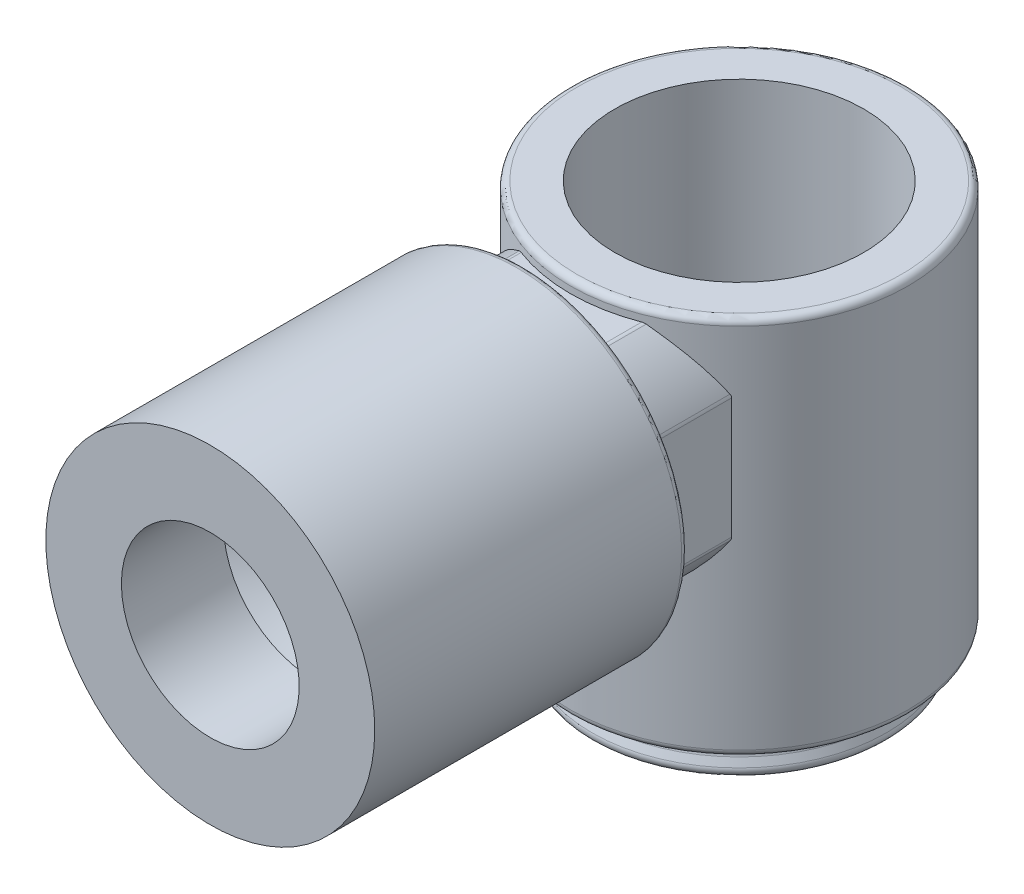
ISO-10303-21;
HEADER;
FILE_DESCRIPTION(('STEP AP214'),'2;1');
FILE_NAME('part.step','',(''),(''),'','','');
FILE_SCHEMA(('AUTOMOTIVE_DESIGN { 1 0 10303 214 1 1 1 1 }'));
ENDSEC;
DATA;
#1=APPLICATION_CONTEXT('core data for automotive mechanical design processes');
#2=APPLICATION_PROTOCOL_DEFINITION('international standard','automotive_design',2000,#1);
#3=PRODUCT_CONTEXT('',#1,'mechanical');
#4=PRODUCT('Part','Part','',(#3));
#5=PRODUCT_RELATED_PRODUCT_CATEGORY('part','',(#4));
#6=PRODUCT_DEFINITION_FORMATION('','',#4);
#7=PRODUCT_DEFINITION_CONTEXT('part definition',#1,'design');
#8=PRODUCT_DEFINITION('design','',#6,#7);
#9=PRODUCT_DEFINITION_SHAPE('','',#8);
#10=(LENGTH_UNIT() NAMED_UNIT(*) SI_UNIT(.MILLI.,.METRE.));
#11=(NAMED_UNIT(*) PLANE_ANGLE_UNIT() SI_UNIT($,.RADIAN.));
#12=(NAMED_UNIT(*) SI_UNIT($,.STERADIAN.) SOLID_ANGLE_UNIT());
#13=UNCERTAINTY_MEASURE_WITH_UNIT(LENGTH_MEASURE(1.E-05),#10,'distance_accuracy_value','');
#14=(GEOMETRIC_REPRESENTATION_CONTEXT(3) GLOBAL_UNCERTAINTY_ASSIGNED_CONTEXT((#13)) GLOBAL_UNIT_ASSIGNED_CONTEXT((#10,
#11,#12)) REPRESENTATION_CONTEXT('',''));
#15=CARTESIAN_POINT('',(0.,0.,0.));
#16=DIRECTION('',(0.,0.,1.));
#17=DIRECTION('',(1.,0.,0.));
#18=AXIS2_PLACEMENT_3D('',#15,#16,#17);
#19=CARTESIAN_POINT('',(0.,11.811,0.));
#20=DIRECTION('',(0.,-1.,0.));
#21=DIRECTION('',(0.,0.,-1.));
#22=AXIS2_PLACEMENT_3D('',#19,#20,#21);
#23=CYLINDRICAL_SURFACE('',#22,4.826);
#24=CARTESIAN_POINT('',(0.,11.6205,0.));
#25=DIRECTION('',(0.,1.,0.));
#26=DIRECTION('',(0.,0.,1.));
#27=AXIS2_PLACEMENT_3D('',#24,#25,#26);
#28=CIRCLE('',#27,4.826);
#29=CARTESIAN_POINT('',(0.,11.6205,4.826));
#30=VERTEX_POINT('',#29);
#31=EDGE_CURVE('E269',#30,#30,#28,.F.);
#32=ORIENTED_EDGE('',*,*,#31,.T.);
#33=EDGE_LOOP('',(#32));
#34=FACE_BOUND('',#33,.T.);
#35=CARTESIAN_POINT('',(0.,1.13373547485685,0.));
#36=DIRECTION('',(0.,-1.,0.));
#37=DIRECTION('',(0.,0.,-1.));
#38=AXIS2_PLACEMENT_3D('',#35,#36,#37);
#39=CIRCLE('',#38,4.826);
#40=CARTESIAN_POINT('',(0.,1.13373547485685,-4.826));
#41=VERTEX_POINT('',#40);
#42=EDGE_CURVE('E266',#41,#41,#39,.F.);
#43=ORIENTED_EDGE('',*,*,#42,.T.);
#44=EDGE_LOOP('',(#43));
#45=FACE_BOUND('',#44,.T.);
#46=DIRECTION('',(0.,-1.,0.));
#47=VECTOR('',#46,1.);
#48=CARTESIAN_POINT('',(3.302,11.811,3.51952724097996));
#49=LINE('',#48,#47);
#50=CARTESIAN_POINT('',(3.302,6.4064589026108,3.51952724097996));
#51=VERTEX_POINT('',#50);
#52=CARTESIAN_POINT('',(3.302,9.8495410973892,3.51952724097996));
#53=VERTEX_POINT('',#52);
#54=EDGE_CURVE('E170',#51,#53,#49,.F.);
#55=ORIENTED_EDGE('',*,*,#54,.F.);
#56=CARTESIAN_POINT('',(3.302,6.4064589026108,3.51952724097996));
#57=CARTESIAN_POINT('',(3.30201456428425,6.39768693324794,3.51951259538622));
#58=CARTESIAN_POINT('',(3.3013950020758,6.38893447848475,3.52009488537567));
#59=CARTESIAN_POINT('',(3.29903623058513,6.37195641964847,3.52230608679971));
#60=CARTESIAN_POINT('',(3.29732733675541,6.36372298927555,3.5239066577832));
#61=CARTESIAN_POINT('',(3.2931001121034,6.34840584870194,3.52785696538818));
#62=CARTESIAN_POINT('',(3.29065639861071,6.34128269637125,3.53013752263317));
#63=CARTESIAN_POINT('',(3.28498600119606,6.32739787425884,3.53541490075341));
#64=CARTESIAN_POINT('',(3.28174109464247,6.32064988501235,3.53842836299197));
#65=CARTESIAN_POINT('',(3.2781875,6.31423348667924,3.54171748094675));
#66=B_SPLINE_CURVE_WITH_KNOTS('',3,(#56,#57,#58,#59,#60,#61,#62,#63,#64,#65),.UNSPECIFIED.,.F.,
.F.,(4,2,2,2,4),(0.,0.0262445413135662,0.0517888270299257,0.0753149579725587,
0.0994355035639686),.UNSPECIFIED.);
#67=CARTESIAN_POINT('',(3.2781875,6.31423348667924,3.54171748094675));
#68=VERTEX_POINT('',#67);
#69=EDGE_CURVE('E393',#51,#68,#66,.T.);
#70=ORIENTED_EDGE('',*,*,#69,.T.);
#71=CARTESIAN_POINT('',(-0.686857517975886,11.811,4.77687164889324));
#72=CARTESIAN_POINT('',(-0.785108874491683,11.7926946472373,4.76276524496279));
#73=CARTESIAN_POINT('',(-0.882161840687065,11.7705099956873,4.74569639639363));
#74=CARTESIAN_POINT('',(-1.07307519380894,11.718891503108,4.70618977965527));
#75=CARTESIAN_POINT('',(-1.16693929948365,11.6894664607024,4.6837585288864));
#76=CARTESIAN_POINT('',(-1.35014249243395,11.6241073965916,4.63425647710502));
#77=CARTESIAN_POINT('',(-1.4395131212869,11.5882304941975,4.60722649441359));
#78=CARTESIAN_POINT('',(-1.6141117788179,11.5103146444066,4.54899974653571));
#79=CARTESIAN_POINT('',(-1.69933862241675,11.4682739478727,4.51780179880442));
#80=CARTESIAN_POINT('',(-1.94742201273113,11.3340887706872,4.41919884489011));
#81=CARTESIAN_POINT('',(-2.10371536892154,11.2335041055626,4.34649392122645));
#82=CARTESIAN_POINT('',(-2.39725917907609,11.0130115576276,4.19179237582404));
#83=CARTESIAN_POINT('',(-2.53445445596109,10.8930497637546,4.10977002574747));
#84=CARTESIAN_POINT('',(-2.80893453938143,10.6159539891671,3.9282542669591));
#85=CARTESIAN_POINT('',(-2.94286586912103,10.455940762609,3.82803694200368));
#86=CARTESIAN_POINT('',(-3.12298564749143,10.200216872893,3.68012479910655));
#87=CARTESIAN_POINT('',(-3.17957441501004,10.1123339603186,3.63121096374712));
#88=CARTESIAN_POINT('',(-3.28563976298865,9.93128463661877,3.53552536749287));
#89=CARTESIAN_POINT('',(-3.33511854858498,9.83811987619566,3.48875294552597));
#90=CARTESIAN_POINT('',(-3.44816446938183,9.60137344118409,3.37776455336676));
#91=CARTESIAN_POINT('',(-3.50742766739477,9.45467086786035,3.31567854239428));
#92=CARTESIAN_POINT('',(-3.60791031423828,9.15016179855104,3.20605966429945));
#93=CARTESIAN_POINT('',(-3.64917045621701,8.99238129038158,3.1584940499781));
#94=CARTESIAN_POINT('',(-3.70537585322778,8.69771789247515,3.09225128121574));
#95=CARTESIAN_POINT('',(-3.72377430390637,8.56235906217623,3.0698606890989));
#96=CARTESIAN_POINT('',(-3.74555822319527,8.28872137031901,3.04325435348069));
#97=CARTESIAN_POINT('',(-3.7489614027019,8.15044614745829,3.03901716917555));
#98=CARTESIAN_POINT('',(-3.74049568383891,7.87515953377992,3.04942569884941));
#99=CARTESIAN_POINT('',(-3.72863077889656,7.73814782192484,3.06406647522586));
#100=CARTESIAN_POINT('',(-3.69058266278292,7.46889025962,3.10977963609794));
#101=CARTESIAN_POINT('',(-3.66437643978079,7.33665243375,3.14087842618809));
#102=CARTESIAN_POINT('',(-3.58480415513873,7.02254645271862,3.23179138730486));
#103=CARTESIAN_POINT('',(-3.52456519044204,6.84437916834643,3.29821829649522));
#104=CARTESIAN_POINT('',(-3.38110305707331,6.50356374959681,3.44513769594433));
#105=CARTESIAN_POINT('',(-3.29780928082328,6.34096538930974,3.52567311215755));
#106=CARTESIAN_POINT('',(-3.14397255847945,6.08714256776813,3.66226968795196));
#107=CARTESIAN_POINT('',(-3.07957969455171,5.99124362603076,3.71674283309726));
#108=CARTESIAN_POINT('',(-2.94238385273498,5.80594441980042,3.82627108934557));
#109=CARTESIAN_POINT('',(-2.86957843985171,5.71654604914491,3.88132636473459));
#110=CARTESIAN_POINT('',(-2.71582302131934,5.54462266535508,3.9904202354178));
#111=CARTESIAN_POINT('',(-2.63488404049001,5.46208861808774,4.04446009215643));
#112=CARTESIAN_POINT('',(-2.46492894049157,5.3041976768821,4.15023401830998));
#113=CARTESIAN_POINT('',(-2.37591198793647,5.2288415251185,4.20196784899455));
#114=CARTESIAN_POINT('',(-2.13394895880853,5.04291981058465,4.33185917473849));
#115=CARTESIAN_POINT('',(-1.97469092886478,4.93835606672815,4.40724717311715));
#116=CARTESIAN_POINT('',(-1.72184922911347,4.79922021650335,4.50930313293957));
#117=CARTESIAN_POINT('',(-1.63522205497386,4.75578553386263,4.54149004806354));
#118=CARTESIAN_POINT('',(-1.45762408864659,4.67530774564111,4.60156232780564));
#119=CARTESIAN_POINT('',(-1.3666552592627,4.63826178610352,4.62944961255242));
#120=CARTESIAN_POINT('',(-1.17992172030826,4.57075334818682,4.68054773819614));
#121=CARTESIAN_POINT('',(-1.08411799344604,4.54036079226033,4.7037087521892));
#122=CARTESIAN_POINT('',(-0.889302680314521,4.4871774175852,4.74439766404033));
#123=CARTESIAN_POINT('',(-0.79029291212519,4.4643823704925,4.76192869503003));
#124=CARTESIAN_POINT('',(-0.589938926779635,4.42683595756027,4.79087529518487));
#125=CARTESIAN_POINT('',(-0.488596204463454,4.41207958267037,4.80229467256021));
#126=CARTESIAN_POINT('',(-0.284532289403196,4.39091288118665,4.81869157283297));
#127=CARTESIAN_POINT('',(-0.181811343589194,4.38450107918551,4.82367023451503));
#128=CARTESIAN_POINT('',(0.00824255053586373,4.38049324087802,4.82678159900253));
#129=CARTESIAN_POINT('',(0.0955383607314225,4.38170411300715,4.82584081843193));
#130=CARTESIAN_POINT('',(0.269683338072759,4.39020194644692,4.8192469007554));
#131=CARTESIAN_POINT('',(0.356532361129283,4.39749075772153,4.8135923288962));
#132=CARTESIAN_POINT('',(0.52906187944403,4.41802727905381,4.79769410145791));
#133=CARTESIAN_POINT('',(0.61474283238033,4.43127258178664,4.78745229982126));
#134=CARTESIAN_POINT('',(0.784383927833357,4.46351193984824,4.7626025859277));
#135=CARTESIAN_POINT('',(0.868343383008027,4.48250824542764,4.74799296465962));
#136=CARTESIAN_POINT('',(1.11195547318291,4.54646635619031,4.69900452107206));
#137=CARTESIAN_POINT('',(1.26855494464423,4.59904843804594,4.65895341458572));
#138=CARTESIAN_POINT('',(1.57016571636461,4.72249310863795,4.56616279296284));
#139=CARTESIAN_POINT('',(1.71517484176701,4.79335911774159,4.51342090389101));
#140=CARTESIAN_POINT('',(2.01086747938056,4.96170845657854,4.39040515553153));
#141=CARTESIAN_POINT('',(2.15964741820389,5.06149952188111,4.31872310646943));
#142=CARTESIAN_POINT('',(2.43914124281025,5.27874253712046,4.16727990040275));
#143=CARTESIAN_POINT('',(2.56983405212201,5.39621476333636,4.08750950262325));
#144=CARTESIAN_POINT('',(2.8383056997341,5.67341452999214,3.907116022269));
#145=CARTESIAN_POINT('',(2.97175815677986,5.83682750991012,3.80564526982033));
#146=CARTESIAN_POINT('',(3.15063592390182,6.09800461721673,3.65648035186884));
#147=CARTESIAN_POINT('',(3.20673220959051,6.18778410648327,3.60724403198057));
#148=CARTESIAN_POINT('',(3.31159479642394,6.37275082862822,3.51121907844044));
#149=CARTESIAN_POINT('',(3.36036376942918,6.46793607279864,3.46442955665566));
#150=CARTESIAN_POINT('',(3.46929886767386,6.70539243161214,3.35594579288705));
#151=CARTESIAN_POINT('',(3.52551449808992,6.85049863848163,3.29635631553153));
#152=CARTESIAN_POINT('',(3.620354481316,7.15125957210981,3.19191466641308));
#153=CARTESIAN_POINT('',(3.6590209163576,7.30688802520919,3.14702731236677));
#154=CARTESIAN_POINT('',(3.71141363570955,7.59910036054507,3.08497436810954));
#155=CARTESIAN_POINT('',(3.72828319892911,7.73436324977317,3.0643712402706));
#156=CARTESIAN_POINT('',(3.74705127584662,8.00741541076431,3.0414029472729));
#157=CARTESIAN_POINT('',(3.74896531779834,8.14520191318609,3.03901886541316));
#158=CARTESIAN_POINT('',(3.73769309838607,8.41901025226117,3.05286506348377));
#159=CARTESIAN_POINT('',(3.72452266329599,8.55503378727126,3.06907583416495));
#160=CARTESIAN_POINT('',(3.68412354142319,8.82213106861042,3.11744704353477));
#161=CARTESIAN_POINT('',(3.65687006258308,8.95319564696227,3.14963560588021));
#162=CARTESIAN_POINT('',(3.57408041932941,9.26806051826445,3.24371863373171));
#163=CARTESIAN_POINT('',(3.51127824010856,9.44786285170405,3.31246555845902));
#164=CARTESIAN_POINT('',(3.36228920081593,9.79127648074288,3.4636081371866));
#165=CARTESIAN_POINT('',(3.27605009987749,9.95485047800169,3.54603412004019));
#166=CARTESIAN_POINT('',(3.07784623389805,10.2726872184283,3.71957939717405));
#167=CARTESIAN_POINT('',(2.96491705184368,10.42622431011,3.81092157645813));
#168=CARTESIAN_POINT('',(2.71656328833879,10.7150423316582,3.99176290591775));
#169=CARTESIAN_POINT('',(2.58114607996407,10.850329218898,4.08126264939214));
#170=CARTESIAN_POINT('',(2.28750526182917,11.1013958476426,4.25284432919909));
#171=CARTESIAN_POINT('',(2.12916391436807,11.2170677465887,4.33488417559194));
#172=CARTESIAN_POINT('',(1.7916626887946,11.4242410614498,4.4848790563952));
#173=CARTESIAN_POINT('',(1.61255832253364,11.5158048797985,4.5528703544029));
#174=CARTESIAN_POINT('',(1.30780400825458,11.6410976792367,4.64702814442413));
#175=CARTESIAN_POINT('',(1.18759320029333,11.6835977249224,4.67928324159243));
#176=CARTESIAN_POINT('',(0.941268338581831,11.756620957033,4.73501722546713));
#177=CARTESIAN_POINT('',(0.815138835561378,11.7871105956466,4.7584715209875));
#178=CARTESIAN_POINT('',(0.686857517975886,11.811,4.77687164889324));
#179=B_SPLINE_CURVE_WITH_KNOTS('',3,(#71,#72,#73,#74,#75,#76,#77,#78,#79,#80,#81,#82,#83,#84,
#85,#86,#87,#88,#89,#90,#91,#92,#93,#94,#95,#96,#97,#98,#99,#100,#101,#102,#103,#104,#105,#106,
#107,#108,#109,#110,#111,#112,#113,#114,#115,#116,#117,#118,#119,#120,#121,#122,#123,#124,#125,
#126,#127,#128,#129,#130,#131,#132,#133,#134,#135,#136,#137,#138,#139,#140,#141,#142,#143,#144,
#145,#146,#147,#148,#149,#150,#151,#152,#153,#154,#155,#156,#157,#158,#159,#160,#161,#162,#163,
#164,#165,#166,#167,#168,#169,#170,#171,#172,#173,#174,#175,#176,#177,#178),.UNSPECIFIED.,.F.,
.F.,(4,2,2,2,2,2,2,2,2,2,2,2,2,2,2,2,2,2,2,2,2,2,2,2,2,2,2,2,2,2,2,2,2,2,2,2,2,2,2,2,2,2,2,2,2,
2,2,2,2,2,2,2,2,4),(0.,0.302602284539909,0.604838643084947,0.904520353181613,1.20428727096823,
1.80044718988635,2.39829525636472,3.08980787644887,3.43573964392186,3.78156388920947,
4.28987856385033,4.79703824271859,5.21050774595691,5.62348876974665,6.03636179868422,
6.44989926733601,7.0450019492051,7.64194775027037,8.02468334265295,8.40752999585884,
8.78986453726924,9.17223856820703,9.78403183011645,10.0900646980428,10.3959604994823,
10.7049312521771,11.0137297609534,11.322335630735,11.630886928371,11.8924829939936,
12.1541587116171,12.4157287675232,12.6774013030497,13.1851039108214,13.6929015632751,
14.2696573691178,14.8470796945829,15.5463736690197,15.8963369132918,16.2461722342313,
16.7445173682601,17.2416610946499,17.6534036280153,18.0647185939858,18.4756024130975,
18.8872120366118,19.4912899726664,20.0967256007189,20.7287819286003,21.3606314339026,
21.995849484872,22.6294067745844,23.0230643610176,23.4178138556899),.UNSPECIFIED.);
#180=CARTESIAN_POINT('',(1.81376651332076,4.8498125,4.47219487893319));
#181=VERTEX_POINT('',#180);
#182=EDGE_CURVE('E174',#181,#68,#179,.T.);
#183=ORIENTED_EDGE('',*,*,#182,.F.);
#184=CARTESIAN_POINT('',(1.81376651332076,4.8498125,4.47219487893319));
#185=CARTESIAN_POINT('',(1.80360702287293,4.84418299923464,4.47631763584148));
#186=CARTESIAN_POINT('',(1.79297908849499,4.83952334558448,4.48058561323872));
#187=CARTESIAN_POINT('',(1.77132495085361,4.83227539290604,4.48918813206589));
#188=CARTESIAN_POINT('',(1.76031047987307,4.82964864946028,4.49351977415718));
#189=CARTESIAN_POINT('',(1.74001681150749,4.82667133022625,4.50141298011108));
#190=CARTESIAN_POINT('',(1.73078348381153,4.82599534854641,4.50497233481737));
#191=CARTESIAN_POINT('',(1.72154109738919,4.826,4.5085));
#192=B_SPLINE_CURVE_WITH_KNOTS('',3,(#184,#185,#186,#187,#188,#189,#190,#191),.UNSPECIFIED.,.F.,
.F.,(4,2,2,4),(0.,0.0369177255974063,0.0731189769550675,0.102782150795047),.UNSPECIFIED.);
#193=CARTESIAN_POINT('',(1.72154109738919,4.826,4.5085));
#194=VERTEX_POINT('',#193);
#195=EDGE_CURVE('E234',#181,#194,#192,.T.);
#196=ORIENTED_EDGE('',*,*,#195,.T.);
#197=CARTESIAN_POINT('',(0.,4.826,0.));
#198=DIRECTION('',(0.,1.,0.));
#199=DIRECTION('',(0.,0.,1.));
#200=AXIS2_PLACEMENT_3D('',#197,#198,#199);
#201=CIRCLE('',#200,4.826);
#202=CARTESIAN_POINT('',(-1.72154109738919,4.826,4.5085));
#203=VERTEX_POINT('',#202);
#204=EDGE_CURVE('E180',#203,#194,#201,.T.);
#205=ORIENTED_EDGE('',*,*,#204,.F.);
#206=CARTESIAN_POINT('',(-1.72154109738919,4.826,4.5085));
#207=CARTESIAN_POINT('',(-1.73305223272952,4.82599195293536,4.50410707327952));
#208=CARTESIAN_POINT('',(-1.74454658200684,4.82704208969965,4.49966530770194));
#209=CARTESIAN_POINT('',(-1.76695445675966,4.83115135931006,4.49091113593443));
#210=CARTESIAN_POINT('',(-1.77787494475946,4.83417080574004,4.48659789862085));
#211=CARTESIAN_POINT('',(-1.79714879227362,4.84139904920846,4.47890885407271));
#212=CARTESIAN_POINT('',(-1.80560946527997,4.84529436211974,4.47550448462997));
#213=CARTESIAN_POINT('',(-1.81376651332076,4.84981249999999,4.47219487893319));
#214=B_SPLINE_CURVE_WITH_KNOTS('',3,(#206,#207,#208,#209,#210,#211,#212,#213),.UNSPECIFIED.,.F.,
.F.,(4,2,2,4),(0.,0.0369225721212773,0.073123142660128,0.10278265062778),.UNSPECIFIED.);
#215=CARTESIAN_POINT('',(-1.81376651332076,4.8498125,4.47219487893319));
#216=VERTEX_POINT('',#215);
#217=EDGE_CURVE('E434',#203,#216,#214,.T.);
#218=ORIENTED_EDGE('',*,*,#217,.T.);
#219=CARTESIAN_POINT('',(-0.686857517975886,11.811,4.77687164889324));
#220=CARTESIAN_POINT('',(-0.785108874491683,11.7926946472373,4.76276524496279));
#221=CARTESIAN_POINT('',(-0.882161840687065,11.7705099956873,4.74569639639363));
#222=CARTESIAN_POINT('',(-1.07307519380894,11.718891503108,4.70618977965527));
#223=CARTESIAN_POINT('',(-1.16693929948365,11.6894664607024,4.6837585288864));
#224=CARTESIAN_POINT('',(-1.35014249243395,11.6241073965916,4.63425647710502));
#225=CARTESIAN_POINT('',(-1.4395131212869,11.5882304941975,4.60722649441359));
#226=CARTESIAN_POINT('',(-1.6141117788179,11.5103146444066,4.54899974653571));
#227=CARTESIAN_POINT('',(-1.69933862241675,11.4682739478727,4.51780179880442));
#228=CARTESIAN_POINT('',(-1.94742201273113,11.3340887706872,4.41919884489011));
#229=CARTESIAN_POINT('',(-2.10371536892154,11.2335041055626,4.34649392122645));
#230=CARTESIAN_POINT('',(-2.39725917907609,11.0130115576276,4.19179237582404));
#231=CARTESIAN_POINT('',(-2.53445445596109,10.8930497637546,4.10977002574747));
#232=CARTESIAN_POINT('',(-2.80893453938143,10.6159539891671,3.9282542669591));
#233=CARTESIAN_POINT('',(-2.94286586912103,10.455940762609,3.82803694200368));
#234=CARTESIAN_POINT('',(-3.12298564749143,10.200216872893,3.68012479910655));
#235=CARTESIAN_POINT('',(-3.17957441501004,10.1123339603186,3.63121096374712));
#236=CARTESIAN_POINT('',(-3.28563976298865,9.93128463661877,3.53552536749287));
#237=CARTESIAN_POINT('',(-3.33511854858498,9.83811987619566,3.48875294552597));
#238=CARTESIAN_POINT('',(-3.44816446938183,9.60137344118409,3.37776455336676));
#239=CARTESIAN_POINT('',(-3.50742766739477,9.45467086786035,3.31567854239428));
#240=CARTESIAN_POINT('',(-3.60791031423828,9.15016179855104,3.20605966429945));
#241=CARTESIAN_POINT('',(-3.64917045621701,8.99238129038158,3.1584940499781));
#242=CARTESIAN_POINT('',(-3.70537585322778,8.69771789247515,3.09225128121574));
#243=CARTESIAN_POINT('',(-3.72377430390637,8.56235906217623,3.0698606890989));
#244=CARTESIAN_POINT('',(-3.74555822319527,8.28872137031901,3.04325435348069));
#245=CARTESIAN_POINT('',(-3.7489614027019,8.15044614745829,3.03901716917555));
#246=CARTESIAN_POINT('',(-3.74049568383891,7.87515953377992,3.04942569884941));
#247=CARTESIAN_POINT('',(-3.72863077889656,7.73814782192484,3.06406647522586));
#248=CARTESIAN_POINT('',(-3.69058266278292,7.46889025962,3.10977963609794));
#249=CARTESIAN_POINT('',(-3.66437643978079,7.33665243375,3.14087842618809));
#250=CARTESIAN_POINT('',(-3.58480415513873,7.02254645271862,3.23179138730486));
#251=CARTESIAN_POINT('',(-3.52456519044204,6.84437916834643,3.29821829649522));
#252=CARTESIAN_POINT('',(-3.38110305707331,6.50356374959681,3.44513769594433));
#253=CARTESIAN_POINT('',(-3.29780928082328,6.34096538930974,3.52567311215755));
#254=CARTESIAN_POINT('',(-3.14397255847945,6.08714256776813,3.66226968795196));
#255=CARTESIAN_POINT('',(-3.07957969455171,5.99124362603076,3.71674283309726));
#256=CARTESIAN_POINT('',(-2.94238385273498,5.80594441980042,3.82627108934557));
#257=CARTESIAN_POINT('',(-2.86957843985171,5.71654604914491,3.88132636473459));
#258=CARTESIAN_POINT('',(-2.71582302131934,5.54462266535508,3.9904202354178));
#259=CARTESIAN_POINT('',(-2.63488404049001,5.46208861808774,4.04446009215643));
#260=CARTESIAN_POINT('',(-2.46492894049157,5.3041976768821,4.15023401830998));
#261=CARTESIAN_POINT('',(-2.37591198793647,5.2288415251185,4.20196784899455));
#262=CARTESIAN_POINT('',(-2.13394895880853,5.04291981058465,4.33185917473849));
#263=CARTESIAN_POINT('',(-1.97469092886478,4.93835606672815,4.40724717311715));
#264=CARTESIAN_POINT('',(-1.72184922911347,4.79922021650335,4.50930313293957));
#265=CARTESIAN_POINT('',(-1.63522205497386,4.75578553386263,4.54149004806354));
#266=CARTESIAN_POINT('',(-1.45762408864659,4.67530774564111,4.60156232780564));
#267=CARTESIAN_POINT('',(-1.3666552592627,4.63826178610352,4.62944961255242));
#268=CARTESIAN_POINT('',(-1.17992172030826,4.57075334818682,4.68054773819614));
#269=CARTESIAN_POINT('',(-1.08411799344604,4.54036079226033,4.7037087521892));
#270=CARTESIAN_POINT('',(-0.889302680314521,4.4871774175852,4.74439766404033));
#271=CARTESIAN_POINT('',(-0.79029291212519,4.4643823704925,4.76192869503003));
#272=CARTESIAN_POINT('',(-0.589938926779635,4.42683595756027,4.79087529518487));
#273=CARTESIAN_POINT('',(-0.488596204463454,4.41207958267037,4.80229467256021));
#274=CARTESIAN_POINT('',(-0.284532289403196,4.39091288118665,4.81869157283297));
#275=CARTESIAN_POINT('',(-0.181811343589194,4.38450107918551,4.82367023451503));
#276=CARTESIAN_POINT('',(0.00824255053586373,4.38049324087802,4.82678159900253));
#277=CARTESIAN_POINT('',(0.0955383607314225,4.38170411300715,4.82584081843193));
#278=CARTESIAN_POINT('',(0.269683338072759,4.39020194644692,4.8192469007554));
#279=CARTESIAN_POINT('',(0.356532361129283,4.39749075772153,4.8135923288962));
#280=CARTESIAN_POINT('',(0.52906187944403,4.41802727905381,4.79769410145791));
#281=CARTESIAN_POINT('',(0.61474283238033,4.43127258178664,4.78745229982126));
#282=CARTESIAN_POINT('',(0.784383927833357,4.46351193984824,4.7626025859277));
#283=CARTESIAN_POINT('',(0.868343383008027,4.48250824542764,4.74799296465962));
#284=CARTESIAN_POINT('',(1.11195547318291,4.54646635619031,4.69900452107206));
#285=CARTESIAN_POINT('',(1.26855494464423,4.59904843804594,4.65895341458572));
#286=CARTESIAN_POINT('',(1.57016571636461,4.72249310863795,4.56616279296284));
#287=CARTESIAN_POINT('',(1.71517484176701,4.79335911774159,4.51342090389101));
#288=CARTESIAN_POINT('',(2.01086747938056,4.96170845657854,4.39040515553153));
#289=CARTESIAN_POINT('',(2.15964741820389,5.06149952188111,4.31872310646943));
#290=CARTESIAN_POINT('',(2.43914124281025,5.27874253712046,4.16727990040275));
#291=CARTESIAN_POINT('',(2.56983405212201,5.39621476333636,4.08750950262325));
#292=CARTESIAN_POINT('',(2.8383056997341,5.67341452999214,3.907116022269));
#293=CARTESIAN_POINT('',(2.97175815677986,5.83682750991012,3.80564526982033));
#294=CARTESIAN_POINT('',(3.15063592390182,6.09800461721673,3.65648035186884));
#295=CARTESIAN_POINT('',(3.20673220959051,6.18778410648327,3.60724403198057));
#296=CARTESIAN_POINT('',(3.31159479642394,6.37275082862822,3.51121907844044));
#297=CARTESIAN_POINT('',(3.36036376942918,6.46793607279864,3.46442955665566));
#298=CARTESIAN_POINT('',(3.46929886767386,6.70539243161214,3.35594579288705));
#299=CARTESIAN_POINT('',(3.52551449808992,6.85049863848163,3.29635631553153));
#300=CARTESIAN_POINT('',(3.620354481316,7.15125957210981,3.19191466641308));
#301=CARTESIAN_POINT('',(3.6590209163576,7.30688802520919,3.14702731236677));
#302=CARTESIAN_POINT('',(3.71141363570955,7.59910036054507,3.08497436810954));
#303=CARTESIAN_POINT('',(3.72828319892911,7.73436324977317,3.0643712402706));
#304=CARTESIAN_POINT('',(3.74705127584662,8.00741541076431,3.0414029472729));
#305=CARTESIAN_POINT('',(3.74896531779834,8.14520191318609,3.03901886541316));
#306=CARTESIAN_POINT('',(3.73769309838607,8.41901025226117,3.05286506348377));
#307=CARTESIAN_POINT('',(3.72452266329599,8.55503378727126,3.06907583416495));
#308=CARTESIAN_POINT('',(3.68412354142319,8.82213106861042,3.11744704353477));
#309=CARTESIAN_POINT('',(3.65687006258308,8.95319564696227,3.14963560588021));
#310=CARTESIAN_POINT('',(3.57408041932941,9.26806051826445,3.24371863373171));
#311=CARTESIAN_POINT('',(3.51127824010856,9.44786285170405,3.31246555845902));
#312=CARTESIAN_POINT('',(3.36228920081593,9.79127648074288,3.4636081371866));
#313=CARTESIAN_POINT('',(3.27605009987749,9.95485047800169,3.54603412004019));
#314=CARTESIAN_POINT('',(3.07784623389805,10.2726872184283,3.71957939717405));
#315=CARTESIAN_POINT('',(2.96491705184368,10.42622431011,3.81092157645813));
#316=CARTESIAN_POINT('',(2.71656328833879,10.7150423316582,3.99176290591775));
#317=CARTESIAN_POINT('',(2.58114607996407,10.850329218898,4.08126264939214));
#318=CARTESIAN_POINT('',(2.28750526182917,11.1013958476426,4.25284432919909));
#319=CARTESIAN_POINT('',(2.12916391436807,11.2170677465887,4.33488417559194));
#320=CARTESIAN_POINT('',(1.7916626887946,11.4242410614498,4.4848790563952));
#321=CARTESIAN_POINT('',(1.61255832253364,11.5158048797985,4.5528703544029));
#322=CARTESIAN_POINT('',(1.30780400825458,11.6410976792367,4.64702814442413));
#323=CARTESIAN_POINT('',(1.18759320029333,11.6835977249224,4.67928324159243));
#324=CARTESIAN_POINT('',(0.941268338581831,11.756620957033,4.73501722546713));
#325=CARTESIAN_POINT('',(0.815138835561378,11.7871105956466,4.7584715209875));
#326=CARTESIAN_POINT('',(0.686857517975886,11.811,4.77687164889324));
#327=B_SPLINE_CURVE_WITH_KNOTS('',3,(#219,#220,#221,#222,#223,#224,#225,#226,#227,#228,#229,
#230,#231,#232,#233,#234,#235,#236,#237,#238,#239,#240,#241,#242,#243,#244,#245,#246,#247,#248,
#249,#250,#251,#252,#253,#254,#255,#256,#257,#258,#259,#260,#261,#262,#263,#264,#265,#266,#267,
#268,#269,#270,#271,#272,#273,#274,#275,#276,#277,#278,#279,#280,#281,#282,#283,#284,#285,#286,
#287,#288,#289,#290,#291,#292,#293,#294,#295,#296,#297,#298,#299,#300,#301,#302,#303,#304,#305,
#306,#307,#308,#309,#310,#311,#312,#313,#314,#315,#316,#317,#318,#319,#320,#321,#322,#323,#324,
#325,#326),.UNSPECIFIED.,.F.,.F.,(4,2,2,2,2,2,2,2,2,2,2,2,2,2,2,2,2,2,2,2,2,2,2,2,2,2,2,2,2,2,2,
2,2,2,2,2,2,2,2,2,2,2,2,2,2,2,2,2,2,2,2,2,2,4),(0.,0.302602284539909,0.604838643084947,
0.904520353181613,1.20428727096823,1.80044718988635,2.39829525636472,3.08980787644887,
3.43573964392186,3.78156388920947,4.28987856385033,4.79703824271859,5.21050774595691,
5.62348876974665,6.03636179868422,6.44989926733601,7.0450019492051,7.64194775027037,
8.02468334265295,8.40752999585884,8.78986453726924,9.17223856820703,9.78403183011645,
10.0900646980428,10.3959604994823,10.7049312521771,11.0137297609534,11.322335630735,
11.630886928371,11.8924829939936,12.1541587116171,12.4157287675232,12.6774013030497,
13.1851039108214,13.6929015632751,14.2696573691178,14.8470796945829,15.5463736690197,
15.8963369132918,16.2461722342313,16.7445173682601,17.2416610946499,17.6534036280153,
18.0647185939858,18.4756024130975,18.8872120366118,19.4912899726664,20.0967256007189,
20.7287819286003,21.3606314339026,21.995849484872,22.6294067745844,23.0230643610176,
23.4178138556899),.UNSPECIFIED.);
#328=CARTESIAN_POINT('',(-3.2781875,6.31423348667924,3.54171748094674));
#329=VERTEX_POINT('',#328);
#330=EDGE_CURVE('E207',#329,#216,#327,.T.);
#331=ORIENTED_EDGE('',*,*,#330,.F.);
#332=CARTESIAN_POINT('',(-3.2781875,6.31423348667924,3.54171748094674));
#333=CARTESIAN_POINT('',(-3.28207284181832,6.32124213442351,3.53812123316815));
#334=CARTESIAN_POINT('',(-3.28558846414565,6.32865588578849,3.53485528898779));
#335=CARTESIAN_POINT('',(-3.29162785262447,6.34393416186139,3.52923202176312));
#336=CARTESIAN_POINT('',(-3.29417589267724,6.35178105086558,3.52685249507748));
#337=CARTESIAN_POINT('',(-3.29807744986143,6.3672562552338,3.52320423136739));
#338=CARTESIAN_POINT('',(-3.29951577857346,6.37484392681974,3.52185670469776));
#339=CARTESIAN_POINT('',(-3.30149399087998,6.39043247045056,3.52000199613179));
#340=CARTESIAN_POINT('',(-3.30201018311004,6.39843894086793,3.51951697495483));
#341=CARTESIAN_POINT('',(-3.302,6.40645890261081,3.51952724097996));
#342=B_SPLINE_CURVE_WITH_KNOTS('',3,(#332,#333,#334,#335,#336,#337,#338,#339,#340,#341),
.UNSPECIFIED.,.F.,.F.,(4,2,2,2,4),(0.,0.0263653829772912,0.0520170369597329,0.0754310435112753,
0.0994383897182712),.UNSPECIFIED.);
#343=CARTESIAN_POINT('',(-3.302,6.40645890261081,3.51952724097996));
#344=VERTEX_POINT('',#343);
#345=EDGE_CURVE('E439',#329,#344,#342,.T.);
#346=ORIENTED_EDGE('',*,*,#345,.T.);
#347=DIRECTION('',(0.,-1.,0.));
#348=VECTOR('',#347,1.);
#349=CARTESIAN_POINT('',(-3.302,11.811,3.51952724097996));
#350=LINE('',#349,#348);
#351=CARTESIAN_POINT('',(-3.302,9.84954109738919,3.51952724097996));
#352=VERTEX_POINT('',#351);
#353=EDGE_CURVE('E358',#352,#344,#350,.T.);
#354=ORIENTED_EDGE('',*,*,#353,.F.);
#355=CARTESIAN_POINT('',(-3.302,9.84954109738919,3.51952724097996));
#356=CARTESIAN_POINT('',(-3.30201456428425,9.85831306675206,3.51951259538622));
#357=CARTESIAN_POINT('',(-3.30139500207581,9.86706552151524,3.52009488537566));
#358=CARTESIAN_POINT('',(-3.29903623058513,9.88404358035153,3.5223060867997));
#359=CARTESIAN_POINT('',(-3.29732733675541,9.89227701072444,3.52390665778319));
#360=CARTESIAN_POINT('',(-3.2931001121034,9.90759415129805,3.52785696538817));
#361=CARTESIAN_POINT('',(-3.29065639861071,9.91471730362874,3.53013752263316));
#362=CARTESIAN_POINT('',(-3.28498600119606,9.92860212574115,3.53541490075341));
#363=CARTESIAN_POINT('',(-3.28174109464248,9.93535011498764,3.53842836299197));
#364=CARTESIAN_POINT('',(-3.2781875,9.94176651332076,3.54171748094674));
#365=B_SPLINE_CURVE_WITH_KNOTS('',3,(#355,#356,#357,#358,#359,#360,#361,#362,#363,#364),
.UNSPECIFIED.,.F.,.F.,(4,2,2,2,4),(0.,0.026244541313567,0.0517888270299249,0.075314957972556,
0.0994355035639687),.UNSPECIFIED.);
#366=CARTESIAN_POINT('',(-3.2781875,9.94176651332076,3.54171748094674));
#367=VERTEX_POINT('',#366);
#368=EDGE_CURVE('E12',#352,#367,#365,.T.);
#369=ORIENTED_EDGE('',*,*,#368,.T.);
#370=CARTESIAN_POINT('',(-0.686857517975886,11.811,4.77687164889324));
#371=CARTESIAN_POINT('',(-0.785108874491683,11.7926946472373,4.76276524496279));
#372=CARTESIAN_POINT('',(-0.882161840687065,11.7705099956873,4.74569639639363));
#373=CARTESIAN_POINT('',(-1.07307519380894,11.718891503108,4.70618977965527));
#374=CARTESIAN_POINT('',(-1.16693929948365,11.6894664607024,4.6837585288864));
#375=CARTESIAN_POINT('',(-1.35014249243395,11.6241073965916,4.63425647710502));
#376=CARTESIAN_POINT('',(-1.4395131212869,11.5882304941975,4.60722649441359));
#377=CARTESIAN_POINT('',(-1.6141117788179,11.5103146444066,4.54899974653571));
#378=CARTESIAN_POINT('',(-1.69933862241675,11.4682739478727,4.51780179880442));
#379=CARTESIAN_POINT('',(-1.94742201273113,11.3340887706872,4.41919884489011));
#380=CARTESIAN_POINT('',(-2.10371536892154,11.2335041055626,4.34649392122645));
#381=CARTESIAN_POINT('',(-2.39725917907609,11.0130115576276,4.19179237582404));
#382=CARTESIAN_POINT('',(-2.53445445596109,10.8930497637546,4.10977002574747));
#383=CARTESIAN_POINT('',(-2.80893453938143,10.6159539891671,3.9282542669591));
#384=CARTESIAN_POINT('',(-2.94286586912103,10.455940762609,3.82803694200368));
#385=CARTESIAN_POINT('',(-3.12298564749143,10.200216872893,3.68012479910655));
#386=CARTESIAN_POINT('',(-3.17957441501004,10.1123339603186,3.63121096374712));
#387=CARTESIAN_POINT('',(-3.28563976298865,9.93128463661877,3.53552536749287));
#388=CARTESIAN_POINT('',(-3.33511854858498,9.83811987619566,3.48875294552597));
#389=CARTESIAN_POINT('',(-3.44816446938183,9.60137344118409,3.37776455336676));
#390=CARTESIAN_POINT('',(-3.50742766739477,9.45467086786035,3.31567854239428));
#391=CARTESIAN_POINT('',(-3.60791031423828,9.15016179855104,3.20605966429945));
#392=CARTESIAN_POINT('',(-3.64917045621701,8.99238129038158,3.1584940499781));
#393=CARTESIAN_POINT('',(-3.70537585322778,8.69771789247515,3.09225128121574));
#394=CARTESIAN_POINT('',(-3.72377430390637,8.56235906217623,3.0698606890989));
#395=CARTESIAN_POINT('',(-3.74555822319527,8.28872137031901,3.04325435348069));
#396=CARTESIAN_POINT('',(-3.7489614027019,8.15044614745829,3.03901716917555));
#397=CARTESIAN_POINT('',(-3.74049568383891,7.87515953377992,3.04942569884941));
#398=CARTESIAN_POINT('',(-3.72863077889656,7.73814782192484,3.06406647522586));
#399=CARTESIAN_POINT('',(-3.69058266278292,7.46889025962,3.10977963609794));
#400=CARTESIAN_POINT('',(-3.66437643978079,7.33665243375,3.14087842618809));
#401=CARTESIAN_POINT('',(-3.58480415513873,7.02254645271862,3.23179138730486));
#402=CARTESIAN_POINT('',(-3.52456519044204,6.84437916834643,3.29821829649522));
#403=CARTESIAN_POINT('',(-3.38110305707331,6.50356374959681,3.44513769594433));
#404=CARTESIAN_POINT('',(-3.29780928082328,6.34096538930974,3.52567311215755));
#405=CARTESIAN_POINT('',(-3.14397255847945,6.08714256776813,3.66226968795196));
#406=CARTESIAN_POINT('',(-3.07957969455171,5.99124362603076,3.71674283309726));
#407=CARTESIAN_POINT('',(-2.94238385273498,5.80594441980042,3.82627108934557));
#408=CARTESIAN_POINT('',(-2.86957843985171,5.71654604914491,3.88132636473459));
#409=CARTESIAN_POINT('',(-2.71582302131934,5.54462266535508,3.9904202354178));
#410=CARTESIAN_POINT('',(-2.63488404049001,5.46208861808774,4.04446009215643));
#411=CARTESIAN_POINT('',(-2.46492894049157,5.3041976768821,4.15023401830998));
#412=CARTESIAN_POINT('',(-2.37591198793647,5.2288415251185,4.20196784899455));
#413=CARTESIAN_POINT('',(-2.13394895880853,5.04291981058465,4.33185917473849));
#414=CARTESIAN_POINT('',(-1.97469092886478,4.93835606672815,4.40724717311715));
#415=CARTESIAN_POINT('',(-1.72184922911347,4.79922021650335,4.50930313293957));
#416=CARTESIAN_POINT('',(-1.63522205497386,4.75578553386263,4.54149004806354));
#417=CARTESIAN_POINT('',(-1.45762408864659,4.67530774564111,4.60156232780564));
#418=CARTESIAN_POINT('',(-1.3666552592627,4.63826178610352,4.62944961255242));
#419=CARTESIAN_POINT('',(-1.17992172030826,4.57075334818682,4.68054773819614));
#420=CARTESIAN_POINT('',(-1.08411799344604,4.54036079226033,4.7037087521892));
#421=CARTESIAN_POINT('',(-0.889302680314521,4.4871774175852,4.74439766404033));
#422=CARTESIAN_POINT('',(-0.79029291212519,4.4643823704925,4.76192869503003));
#423=CARTESIAN_POINT('',(-0.589938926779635,4.42683595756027,4.79087529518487));
#424=CARTESIAN_POINT('',(-0.488596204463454,4.41207958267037,4.80229467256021));
#425=CARTESIAN_POINT('',(-0.284532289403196,4.39091288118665,4.81869157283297));
#426=CARTESIAN_POINT('',(-0.181811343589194,4.38450107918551,4.82367023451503));
#427=CARTESIAN_POINT('',(0.00824255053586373,4.38049324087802,4.82678159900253));
#428=CARTESIAN_POINT('',(0.0955383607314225,4.38170411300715,4.82584081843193));
#429=CARTESIAN_POINT('',(0.269683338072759,4.39020194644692,4.8192469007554));
#430=CARTESIAN_POINT('',(0.356532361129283,4.39749075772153,4.8135923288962));
#431=CARTESIAN_POINT('',(0.52906187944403,4.41802727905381,4.79769410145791));
#432=CARTESIAN_POINT('',(0.61474283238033,4.43127258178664,4.78745229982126));
#433=CARTESIAN_POINT('',(0.784383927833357,4.46351193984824,4.7626025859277));
#434=CARTESIAN_POINT('',(0.868343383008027,4.48250824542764,4.74799296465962));
#435=CARTESIAN_POINT('',(1.11195547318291,4.54646635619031,4.69900452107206));
#436=CARTESIAN_POINT('',(1.26855494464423,4.59904843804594,4.65895341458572));
#437=CARTESIAN_POINT('',(1.57016571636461,4.72249310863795,4.56616279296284));
#438=CARTESIAN_POINT('',(1.71517484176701,4.79335911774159,4.51342090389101));
#439=CARTESIAN_POINT('',(2.01086747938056,4.96170845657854,4.39040515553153));
#440=CARTESIAN_POINT('',(2.15964741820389,5.06149952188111,4.31872310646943));
#441=CARTESIAN_POINT('',(2.43914124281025,5.27874253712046,4.16727990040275));
#442=CARTESIAN_POINT('',(2.56983405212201,5.39621476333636,4.08750950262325));
#443=CARTESIAN_POINT('',(2.8383056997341,5.67341452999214,3.907116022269));
#444=CARTESIAN_POINT('',(2.97175815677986,5.83682750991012,3.80564526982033));
#445=CARTESIAN_POINT('',(3.15063592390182,6.09800461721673,3.65648035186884));
#446=CARTESIAN_POINT('',(3.20673220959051,6.18778410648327,3.60724403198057));
#447=CARTESIAN_POINT('',(3.31159479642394,6.37275082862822,3.51121907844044));
#448=CARTESIAN_POINT('',(3.36036376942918,6.46793607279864,3.46442955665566));
#449=CARTESIAN_POINT('',(3.46929886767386,6.70539243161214,3.35594579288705));
#450=CARTESIAN_POINT('',(3.52551449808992,6.85049863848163,3.29635631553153));
#451=CARTESIAN_POINT('',(3.620354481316,7.15125957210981,3.19191466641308));
#452=CARTESIAN_POINT('',(3.6590209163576,7.30688802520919,3.14702731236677));
#453=CARTESIAN_POINT('',(3.71141363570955,7.59910036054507,3.08497436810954));
#454=CARTESIAN_POINT('',(3.72828319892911,7.73436324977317,3.0643712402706));
#455=CARTESIAN_POINT('',(3.74705127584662,8.00741541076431,3.0414029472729));
#456=CARTESIAN_POINT('',(3.74896531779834,8.14520191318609,3.03901886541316));
#457=CARTESIAN_POINT('',(3.73769309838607,8.41901025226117,3.05286506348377));
#458=CARTESIAN_POINT('',(3.72452266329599,8.55503378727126,3.06907583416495));
#459=CARTESIAN_POINT('',(3.68412354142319,8.82213106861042,3.11744704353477));
#460=CARTESIAN_POINT('',(3.65687006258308,8.95319564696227,3.14963560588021));
#461=CARTESIAN_POINT('',(3.57408041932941,9.26806051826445,3.24371863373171));
#462=CARTESIAN_POINT('',(3.51127824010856,9.44786285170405,3.31246555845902));
#463=CARTESIAN_POINT('',(3.36228920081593,9.79127648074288,3.4636081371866));
#464=CARTESIAN_POINT('',(3.27605009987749,9.95485047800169,3.54603412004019));
#465=CARTESIAN_POINT('',(3.07784623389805,10.2726872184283,3.71957939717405));
#466=CARTESIAN_POINT('',(2.96491705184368,10.42622431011,3.81092157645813));
#467=CARTESIAN_POINT('',(2.71656328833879,10.7150423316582,3.99176290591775));
#468=CARTESIAN_POINT('',(2.58114607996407,10.850329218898,4.08126264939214));
#469=CARTESIAN_POINT('',(2.28750526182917,11.1013958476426,4.25284432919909));
#470=CARTESIAN_POINT('',(2.12916391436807,11.2170677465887,4.33488417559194));
#471=CARTESIAN_POINT('',(1.7916626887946,11.4242410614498,4.4848790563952));
#472=CARTESIAN_POINT('',(1.61255832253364,11.5158048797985,4.5528703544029));
#473=CARTESIAN_POINT('',(1.30780400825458,11.6410976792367,4.64702814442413));
#474=CARTESIAN_POINT('',(1.18759320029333,11.6835977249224,4.67928324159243));
#475=CARTESIAN_POINT('',(0.941268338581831,11.756620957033,4.73501722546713));
#476=CARTESIAN_POINT('',(0.815138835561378,11.7871105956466,4.7584715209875));
#477=CARTESIAN_POINT('',(0.686857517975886,11.811,4.77687164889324));
#478=B_SPLINE_CURVE_WITH_KNOTS('',3,(#370,#371,#372,#373,#374,#375,#376,#377,#378,#379,#380,
#381,#382,#383,#384,#385,#386,#387,#388,#389,#390,#391,#392,#393,#394,#395,#396,#397,#398,#399,
#400,#401,#402,#403,#404,#405,#406,#407,#408,#409,#410,#411,#412,#413,#414,#415,#416,#417,#418,
#419,#420,#421,#422,#423,#424,#425,#426,#427,#428,#429,#430,#431,#432,#433,#434,#435,#436,#437,
#438,#439,#440,#441,#442,#443,#444,#445,#446,#447,#448,#449,#450,#451,#452,#453,#454,#455,#456,
#457,#458,#459,#460,#461,#462,#463,#464,#465,#466,#467,#468,#469,#470,#471,#472,#473,#474,#475,
#476,#477),.UNSPECIFIED.,.F.,.F.,(4,2,2,2,2,2,2,2,2,2,2,2,2,2,2,2,2,2,2,2,2,2,2,2,2,2,2,2,2,2,2,
2,2,2,2,2,2,2,2,2,2,2,2,2,2,2,2,2,2,2,2,2,2,4),(0.,0.302602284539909,0.604838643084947,
0.904520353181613,1.20428727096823,1.80044718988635,2.39829525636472,3.08980787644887,
3.43573964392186,3.78156388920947,4.28987856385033,4.79703824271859,5.21050774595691,
5.62348876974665,6.03636179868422,6.44989926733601,7.0450019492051,7.64194775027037,
8.02468334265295,8.40752999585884,8.78986453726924,9.17223856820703,9.78403183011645,
10.0900646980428,10.3959604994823,10.7049312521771,11.0137297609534,11.322335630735,
11.630886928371,11.8924829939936,12.1541587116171,12.4157287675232,12.6774013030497,
13.1851039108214,13.6929015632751,14.2696573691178,14.8470796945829,15.5463736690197,
15.8963369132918,16.2461722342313,16.7445173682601,17.2416610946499,17.6534036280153,
18.0647185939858,18.4756024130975,18.8872120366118,19.4912899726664,20.0967256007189,
20.7287819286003,21.3606314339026,21.995849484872,22.6294067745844,23.0230643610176,
23.4178138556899),.UNSPECIFIED.);
#479=CARTESIAN_POINT('',(-1.81376651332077,11.4061875,4.47219487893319));
#480=VERTEX_POINT('',#479);
#481=EDGE_CURVE('E214',#480,#367,#478,.T.);
#482=ORIENTED_EDGE('',*,*,#481,.F.);
#483=CARTESIAN_POINT('',(-1.81376651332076,11.4061875,4.47219487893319));
#484=CARTESIAN_POINT('',(-1.80360702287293,11.4118170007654,4.47631763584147));
#485=CARTESIAN_POINT('',(-1.792979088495,11.4164766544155,4.48058561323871));
#486=CARTESIAN_POINT('',(-1.77132495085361,11.423724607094,4.48918813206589));
#487=CARTESIAN_POINT('',(-1.76031047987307,11.4263513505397,4.49351977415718));
#488=CARTESIAN_POINT('',(-1.74001681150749,11.4293286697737,4.50141298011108));
#489=CARTESIAN_POINT('',(-1.73078348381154,11.4300046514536,4.50497233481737));
#490=CARTESIAN_POINT('',(-1.7215410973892,11.43,4.5085));
#491=B_SPLINE_CURVE_WITH_KNOTS('',3,(#483,#484,#485,#486,#487,#488,#489,#490),.UNSPECIFIED.,.F.,
.F.,(4,2,2,4),(0.,0.0369177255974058,0.0731189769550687,0.102782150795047),.UNSPECIFIED.);
#492=CARTESIAN_POINT('',(-1.7215410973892,11.43,4.5085));
#493=VERTEX_POINT('',#492);
#494=EDGE_CURVE('E463',#480,#493,#491,.T.);
#495=ORIENTED_EDGE('',*,*,#494,.T.);
#496=CARTESIAN_POINT('',(0.,11.43,0.));
#497=DIRECTION('',(0.,-1.,0.));
#498=DIRECTION('',(0.,0.,-1.));
#499=AXIS2_PLACEMENT_3D('',#496,#497,#498);
#500=CIRCLE('',#499,4.826);
#501=CARTESIAN_POINT('',(1.7215410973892,11.43,4.5085));
#502=VERTEX_POINT('',#501);
#503=EDGE_CURVE('E175',#502,#493,#500,.T.);
#504=ORIENTED_EDGE('',*,*,#503,.F.);
#505=CARTESIAN_POINT('',(1.7215410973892,11.43,4.5085));
#506=CARTESIAN_POINT('',(1.73305223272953,11.4300080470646,4.50410707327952));
#507=CARTESIAN_POINT('',(1.74454658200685,11.4289579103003,4.49966530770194));
#508=CARTESIAN_POINT('',(1.76695445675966,11.4248486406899,4.49091113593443));
#509=CARTESIAN_POINT('',(1.77787494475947,11.42182919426,4.48659789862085));
#510=CARTESIAN_POINT('',(1.79714879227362,11.4146009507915,4.4789088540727));
#511=CARTESIAN_POINT('',(1.80560946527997,11.4107056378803,4.47550448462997));
#512=CARTESIAN_POINT('',(1.81376651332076,11.4061875,4.47219487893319));
#513=B_SPLINE_CURVE_WITH_KNOTS('',3,(#505,#506,#507,#508,#509,#510,#511,#512),.UNSPECIFIED.,.F.,
.F.,(4,2,2,4),(0.,0.0369225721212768,0.0731231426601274,0.10278265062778),.UNSPECIFIED.);
#514=CARTESIAN_POINT('',(1.81376651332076,11.4061875,4.47219487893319));
#515=VERTEX_POINT('',#514);
#516=EDGE_CURVE('E158',#502,#515,#513,.T.);
#517=ORIENTED_EDGE('',*,*,#516,.T.);
#518=CARTESIAN_POINT('',(-0.686857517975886,11.811,4.77687164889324));
#519=CARTESIAN_POINT('',(-0.785108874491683,11.7926946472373,4.76276524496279));
#520=CARTESIAN_POINT('',(-0.882161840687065,11.7705099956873,4.74569639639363));
#521=CARTESIAN_POINT('',(-1.07307519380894,11.718891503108,4.70618977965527));
#522=CARTESIAN_POINT('',(-1.16693929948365,11.6894664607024,4.6837585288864));
#523=CARTESIAN_POINT('',(-1.35014249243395,11.6241073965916,4.63425647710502));
#524=CARTESIAN_POINT('',(-1.4395131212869,11.5882304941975,4.60722649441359));
#525=CARTESIAN_POINT('',(-1.6141117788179,11.5103146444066,4.54899974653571));
#526=CARTESIAN_POINT('',(-1.69933862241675,11.4682739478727,4.51780179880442));
#527=CARTESIAN_POINT('',(-1.94742201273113,11.3340887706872,4.41919884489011));
#528=CARTESIAN_POINT('',(-2.10371536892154,11.2335041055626,4.34649392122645));
#529=CARTESIAN_POINT('',(-2.39725917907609,11.0130115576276,4.19179237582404));
#530=CARTESIAN_POINT('',(-2.53445445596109,10.8930497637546,4.10977002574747));
#531=CARTESIAN_POINT('',(-2.80893453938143,10.6159539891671,3.9282542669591));
#532=CARTESIAN_POINT('',(-2.94286586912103,10.455940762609,3.82803694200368));
#533=CARTESIAN_POINT('',(-3.12298564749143,10.200216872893,3.68012479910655));
#534=CARTESIAN_POINT('',(-3.17957441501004,10.1123339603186,3.63121096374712));
#535=CARTESIAN_POINT('',(-3.28563976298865,9.93128463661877,3.53552536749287));
#536=CARTESIAN_POINT('',(-3.33511854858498,9.83811987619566,3.48875294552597));
#537=CARTESIAN_POINT('',(-3.44816446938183,9.60137344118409,3.37776455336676));
#538=CARTESIAN_POINT('',(-3.50742766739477,9.45467086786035,3.31567854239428));
#539=CARTESIAN_POINT('',(-3.60791031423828,9.15016179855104,3.20605966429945));
#540=CARTESIAN_POINT('',(-3.64917045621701,8.99238129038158,3.1584940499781));
#541=CARTESIAN_POINT('',(-3.70537585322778,8.69771789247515,3.09225128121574));
#542=CARTESIAN_POINT('',(-3.72377430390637,8.56235906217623,3.0698606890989));
#543=CARTESIAN_POINT('',(-3.74555822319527,8.28872137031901,3.04325435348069));
#544=CARTESIAN_POINT('',(-3.7489614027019,8.15044614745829,3.03901716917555));
#545=CARTESIAN_POINT('',(-3.74049568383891,7.87515953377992,3.04942569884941));
#546=CARTESIAN_POINT('',(-3.72863077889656,7.73814782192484,3.06406647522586));
#547=CARTESIAN_POINT('',(-3.69058266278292,7.46889025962,3.10977963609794));
#548=CARTESIAN_POINT('',(-3.66437643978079,7.33665243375,3.14087842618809));
#549=CARTESIAN_POINT('',(-3.58480415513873,7.02254645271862,3.23179138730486));
#550=CARTESIAN_POINT('',(-3.52456519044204,6.84437916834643,3.29821829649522));
#551=CARTESIAN_POINT('',(-3.38110305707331,6.50356374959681,3.44513769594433));
#552=CARTESIAN_POINT('',(-3.29780928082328,6.34096538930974,3.52567311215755));
#553=CARTESIAN_POINT('',(-3.14397255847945,6.08714256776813,3.66226968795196));
#554=CARTESIAN_POINT('',(-3.07957969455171,5.99124362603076,3.71674283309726));
#555=CARTESIAN_POINT('',(-2.94238385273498,5.80594441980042,3.82627108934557));
#556=CARTESIAN_POINT('',(-2.86957843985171,5.71654604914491,3.88132636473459));
#557=CARTESIAN_POINT('',(-2.71582302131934,5.54462266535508,3.9904202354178));
#558=CARTESIAN_POINT('',(-2.63488404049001,5.46208861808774,4.04446009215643));
#559=CARTESIAN_POINT('',(-2.46492894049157,5.3041976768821,4.15023401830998));
#560=CARTESIAN_POINT('',(-2.37591198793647,5.2288415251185,4.20196784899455));
#561=CARTESIAN_POINT('',(-2.13394895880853,5.04291981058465,4.33185917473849));
#562=CARTESIAN_POINT('',(-1.97469092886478,4.93835606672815,4.40724717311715));
#563=CARTESIAN_POINT('',(-1.72184922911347,4.79922021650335,4.50930313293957));
#564=CARTESIAN_POINT('',(-1.63522205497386,4.75578553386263,4.54149004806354));
#565=CARTESIAN_POINT('',(-1.45762408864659,4.67530774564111,4.60156232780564));
#566=CARTESIAN_POINT('',(-1.3666552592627,4.63826178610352,4.62944961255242));
#567=CARTESIAN_POINT('',(-1.17992172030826,4.57075334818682,4.68054773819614));
#568=CARTESIAN_POINT('',(-1.08411799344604,4.54036079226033,4.7037087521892));
#569=CARTESIAN_POINT('',(-0.889302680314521,4.4871774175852,4.74439766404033));
#570=CARTESIAN_POINT('',(-0.79029291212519,4.4643823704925,4.76192869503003));
#571=CARTESIAN_POINT('',(-0.589938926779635,4.42683595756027,4.79087529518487));
#572=CARTESIAN_POINT('',(-0.488596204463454,4.41207958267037,4.80229467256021));
#573=CARTESIAN_POINT('',(-0.284532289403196,4.39091288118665,4.81869157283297));
#574=CARTESIAN_POINT('',(-0.181811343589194,4.38450107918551,4.82367023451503));
#575=CARTESIAN_POINT('',(0.00824255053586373,4.38049324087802,4.82678159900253));
#576=CARTESIAN_POINT('',(0.0955383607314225,4.38170411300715,4.82584081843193));
#577=CARTESIAN_POINT('',(0.269683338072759,4.39020194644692,4.8192469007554));
#578=CARTESIAN_POINT('',(0.356532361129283,4.39749075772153,4.8135923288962));
#579=CARTESIAN_POINT('',(0.52906187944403,4.41802727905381,4.79769410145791));
#580=CARTESIAN_POINT('',(0.61474283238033,4.43127258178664,4.78745229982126));
#581=CARTESIAN_POINT('',(0.784383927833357,4.46351193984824,4.7626025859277));
#582=CARTESIAN_POINT('',(0.868343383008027,4.48250824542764,4.74799296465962));
#583=CARTESIAN_POINT('',(1.11195547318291,4.54646635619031,4.69900452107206));
#584=CARTESIAN_POINT('',(1.26855494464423,4.59904843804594,4.65895341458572));
#585=CARTESIAN_POINT('',(1.57016571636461,4.72249310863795,4.56616279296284));
#586=CARTESIAN_POINT('',(1.71517484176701,4.79335911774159,4.51342090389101));
#587=CARTESIAN_POINT('',(2.01086747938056,4.96170845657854,4.39040515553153));
#588=CARTESIAN_POINT('',(2.15964741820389,5.06149952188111,4.31872310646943));
#589=CARTESIAN_POINT('',(2.43914124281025,5.27874253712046,4.16727990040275));
#590=CARTESIAN_POINT('',(2.56983405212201,5.39621476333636,4.08750950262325));
#591=CARTESIAN_POINT('',(2.8383056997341,5.67341452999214,3.907116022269));
#592=CARTESIAN_POINT('',(2.97175815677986,5.83682750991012,3.80564526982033));
#593=CARTESIAN_POINT('',(3.15063592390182,6.09800461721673,3.65648035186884));
#594=CARTESIAN_POINT('',(3.20673220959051,6.18778410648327,3.60724403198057));
#595=CARTESIAN_POINT('',(3.31159479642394,6.37275082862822,3.51121907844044));
#596=CARTESIAN_POINT('',(3.36036376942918,6.46793607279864,3.46442955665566));
#597=CARTESIAN_POINT('',(3.46929886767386,6.70539243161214,3.35594579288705));
#598=CARTESIAN_POINT('',(3.52551449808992,6.85049863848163,3.29635631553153));
#599=CARTESIAN_POINT('',(3.620354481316,7.15125957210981,3.19191466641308));
#600=CARTESIAN_POINT('',(3.6590209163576,7.30688802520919,3.14702731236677));
#601=CARTESIAN_POINT('',(3.71141363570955,7.59910036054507,3.08497436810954));
#602=CARTESIAN_POINT('',(3.72828319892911,7.73436324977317,3.0643712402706));
#603=CARTESIAN_POINT('',(3.74705127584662,8.00741541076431,3.0414029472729));
#604=CARTESIAN_POINT('',(3.74896531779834,8.14520191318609,3.03901886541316));
#605=CARTESIAN_POINT('',(3.73769309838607,8.41901025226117,3.05286506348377));
#606=CARTESIAN_POINT('',(3.72452266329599,8.55503378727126,3.06907583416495));
#607=CARTESIAN_POINT('',(3.68412354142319,8.82213106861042,3.11744704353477));
#608=CARTESIAN_POINT('',(3.65687006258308,8.95319564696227,3.14963560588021));
#609=CARTESIAN_POINT('',(3.57408041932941,9.26806051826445,3.24371863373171));
#610=CARTESIAN_POINT('',(3.51127824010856,9.44786285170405,3.31246555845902));
#611=CARTESIAN_POINT('',(3.36228920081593,9.79127648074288,3.4636081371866));
#612=CARTESIAN_POINT('',(3.27605009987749,9.95485047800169,3.54603412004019));
#613=CARTESIAN_POINT('',(3.07784623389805,10.2726872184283,3.71957939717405));
#614=CARTESIAN_POINT('',(2.96491705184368,10.42622431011,3.81092157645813));
#615=CARTESIAN_POINT('',(2.71656328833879,10.7150423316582,3.99176290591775));
#616=CARTESIAN_POINT('',(2.58114607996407,10.850329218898,4.08126264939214));
#617=CARTESIAN_POINT('',(2.28750526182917,11.1013958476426,4.25284432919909));
#618=CARTESIAN_POINT('',(2.12916391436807,11.2170677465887,4.33488417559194));
#619=CARTESIAN_POINT('',(1.7916626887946,11.4242410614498,4.4848790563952));
#620=CARTESIAN_POINT('',(1.61255832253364,11.5158048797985,4.5528703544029));
#621=CARTESIAN_POINT('',(1.30780400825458,11.6410976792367,4.64702814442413));
#622=CARTESIAN_POINT('',(1.18759320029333,11.6835977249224,4.67928324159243));
#623=CARTESIAN_POINT('',(0.941268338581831,11.756620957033,4.73501722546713));
#624=CARTESIAN_POINT('',(0.815138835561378,11.7871105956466,4.7584715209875));
#625=CARTESIAN_POINT('',(0.686857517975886,11.811,4.77687164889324));
#626=B_SPLINE_CURVE_WITH_KNOTS('',3,(#518,#519,#520,#521,#522,#523,#524,#525,#526,#527,#528,
#529,#530,#531,#532,#533,#534,#535,#536,#537,#538,#539,#540,#541,#542,#543,#544,#545,#546,#547,
#548,#549,#550,#551,#552,#553,#554,#555,#556,#557,#558,#559,#560,#561,#562,#563,#564,#565,#566,
#567,#568,#569,#570,#571,#572,#573,#574,#575,#576,#577,#578,#579,#580,#581,#582,#583,#584,#585,
#586,#587,#588,#589,#590,#591,#592,#593,#594,#595,#596,#597,#598,#599,#600,#601,#602,#603,#604,
#605,#606,#607,#608,#609,#610,#611,#612,#613,#614,#615,#616,#617,#618,#619,#620,#621,#622,#623,
#624,#625),.UNSPECIFIED.,.F.,.F.,(4,2,2,2,2,2,2,2,2,2,2,2,2,2,2,2,2,2,2,2,2,2,2,2,2,2,2,2,2,2,2,
2,2,2,2,2,2,2,2,2,2,2,2,2,2,2,2,2,2,2,2,2,2,4),(0.,0.302602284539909,0.604838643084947,
0.904520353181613,1.20428727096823,1.80044718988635,2.39829525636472,3.08980787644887,
3.43573964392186,3.78156388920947,4.28987856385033,4.79703824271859,5.21050774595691,
5.62348876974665,6.03636179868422,6.44989926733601,7.0450019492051,7.64194775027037,
8.02468334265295,8.40752999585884,8.78986453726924,9.17223856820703,9.78403183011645,
10.0900646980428,10.3959604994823,10.7049312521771,11.0137297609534,11.322335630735,
11.630886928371,11.8924829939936,12.1541587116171,12.4157287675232,12.6774013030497,
13.1851039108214,13.6929015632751,14.2696573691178,14.8470796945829,15.5463736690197,
15.8963369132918,16.2461722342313,16.7445173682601,17.2416610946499,17.6534036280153,
18.0647185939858,18.4756024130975,18.8872120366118,19.4912899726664,20.0967256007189,
20.7287819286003,21.3606314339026,21.995849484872,22.6294067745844,23.0230643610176,
23.4178138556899),.UNSPECIFIED.);
#627=CARTESIAN_POINT('',(3.2781875,9.94176651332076,3.54171748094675));
#628=VERTEX_POINT('',#627);
#629=EDGE_CURVE('E165',#628,#515,#626,.T.);
#630=ORIENTED_EDGE('',*,*,#629,.F.);
#631=CARTESIAN_POINT('',(3.2781875,9.94176651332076,3.54171748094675));
#632=CARTESIAN_POINT('',(3.28207284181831,9.9347578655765,3.53812123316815));
#633=CARTESIAN_POINT('',(3.28558846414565,9.92734411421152,3.53485528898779));
#634=CARTESIAN_POINT('',(3.29162785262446,9.91206583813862,3.52923202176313));
#635=CARTESIAN_POINT('',(3.29417589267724,9.90421894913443,3.52685249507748));
#636=CARTESIAN_POINT('',(3.29807744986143,9.88874374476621,3.52320423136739));
#637=CARTESIAN_POINT('',(3.29951577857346,9.88115607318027,3.52185670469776));
#638=CARTESIAN_POINT('',(3.30149399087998,9.86556752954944,3.5200019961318));
#639=CARTESIAN_POINT('',(3.30201018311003,9.85756105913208,3.51951697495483));
#640=CARTESIAN_POINT('',(3.302,9.8495410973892,3.51952724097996));
#641=B_SPLINE_CURVE_WITH_KNOTS('',3,(#631,#632,#633,#634,#635,#636,#637,#638,#639,#640),
.UNSPECIFIED.,.F.,.F.,(4,2,2,2,4),(0.,0.0263653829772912,0.0520170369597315,0.0754310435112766,
0.0994383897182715),.UNSPECIFIED.);
#642=EDGE_CURVE('E147',#628,#53,#641,.T.);
#643=ORIENTED_EDGE('',*,*,#642,.T.);
#644=EDGE_LOOP('',(#55,#70,#183,#196,#205,#218,#331,#346,#354,#369,#482,#495,#504,#517,#630,#643));
#645=FACE_BOUND('',#644,.T.);
#646=ADVANCED_FACE('F29',(#34,#45,#645),#23,.T.);
#647=CARTESIAN_POINT('',(0.,0.,0.));
#648=DIRECTION('',(0.,1.,0.));
#649=DIRECTION('',(0.,0.,1.));
#650=AXIS2_PLACEMENT_3D('',#647,#648,#649);
#651=PLANE('',#650);
#652=CARTESIAN_POINT('',(0.,0.,0.));
#653=DIRECTION('',(0.,1.,0.));
#654=DIRECTION('',(0.,0.,1.));
#655=AXIS2_PLACEMENT_3D('',#652,#653,#654);
#656=CIRCLE('',#655,4.03662522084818);
#657=CARTESIAN_POINT('',(0.,0.,4.03662522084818));
#658=VERTEX_POINT('',#657);
#659=EDGE_CURVE('E284',#658,#658,#656,.F.);
#660=ORIENTED_EDGE('',*,*,#659,.T.);
#661=EDGE_LOOP('',(#660));
#662=FACE_BOUND('',#661,.T.);
#663=CARTESIAN_POINT('',(0.,0.,0.));
#664=DIRECTION('',(0.,1.,0.));
#665=DIRECTION('',(0.,0.,1.));
#666=AXIS2_PLACEMENT_3D('',#663,#664,#665);
#667=CIRCLE('',#666,3.556);
#668=CARTESIAN_POINT('',(0.,0.,3.556));
#669=VERTEX_POINT('',#668);
#670=EDGE_CURVE('E331',#669,#669,#667,.T.);
#671=ORIENTED_EDGE('',*,*,#670,.T.);
#672=EDGE_LOOP('',(#671));
#673=FACE_BOUND('',#672,.T.);
#674=ADVANCED_FACE('F500',(#662,#673),#651,.F.);
#675=CARTESIAN_POINT('',(0.,11.811,0.));
#676=DIRECTION('',(0.,1.,0.));
#677=DIRECTION('',(0.,0.,1.));
#678=AXIS2_PLACEMENT_3D('',#675,#676,#677);
#679=PLANE('',#678);
#680=CARTESIAN_POINT('',(0.,11.811,0.));
#681=DIRECTION('',(0.,1.,0.));
#682=DIRECTION('',(0.,0.,1.));
#683=AXIS2_PLACEMENT_3D('',#680,#681,#682);
#684=CIRCLE('',#683,4.6355);
#685=CARTESIAN_POINT('',(0.,11.811,4.6355));
#686=VERTEX_POINT('',#685);
#687=EDGE_CURVE('E263',#686,#686,#684,.T.);
#688=ORIENTED_EDGE('',*,*,#687,.T.);
#689=EDGE_LOOP('',(#688));
#690=FACE_BOUND('',#689,.T.);
#691=CARTESIAN_POINT('',(0.,11.811,0.));
#692=DIRECTION('',(0.,1.,0.));
#693=DIRECTION('',(0.,0.,1.));
#694=AXIS2_PLACEMENT_3D('',#691,#692,#693);
#695=CIRCLE('',#694,3.556);
#696=CARTESIAN_POINT('',(0.,11.811,3.556));
#697=VERTEX_POINT('',#696);
#698=EDGE_CURVE('E560',#697,#697,#695,.T.);
#699=ORIENTED_EDGE('',*,*,#698,.F.);
#700=EDGE_LOOP('',(#699));
#701=FACE_BOUND('',#700,.T.);
#702=ADVANCED_FACE('F197',(#690,#701),#679,.T.);
#703=CARTESIAN_POINT('',(0.,8.128,8.05399987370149));
#704=DIRECTION('',(0.,0.,1.));
#705=DIRECTION('',(1.,0.,0.));
#706=AXIS2_PLACEMENT_3D('',#703,#704,#705);
#707=CYLINDRICAL_SURFACE('',#706,3.7465);
#708=CARTESIAN_POINT('',(0.,8.128,5.77884195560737));
#709=DIRECTION('',(0.,0.,1.));
#710=DIRECTION('',(1.,0.,0.));
#711=AXIS2_PLACEMENT_3D('',#708,#709,#710);
#712=CIRCLE('',#711,3.7465);
#713=CARTESIAN_POINT('',(-3.2781875,9.94176651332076,5.77884195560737));
#714=VERTEX_POINT('',#713);
#715=CARTESIAN_POINT('',(-1.81376651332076,11.4061875,5.77884195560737));
#716=VERTEX_POINT('',#715);
#717=EDGE_CURVE('E383',#714,#716,#712,.F.);
#718=ORIENTED_EDGE('',*,*,#717,.T.);
#719=DIRECTION('',(0.,0.,1.));
#720=VECTOR('',#719,1.);
#721=CARTESIAN_POINT('',(-1.81376651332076,11.4061875,8.05399987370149));
#722=LINE('',#721,#720);
#723=EDGE_CURVE('E254',#716,#480,#722,.F.);
#724=ORIENTED_EDGE('',*,*,#723,.T.);
#725=ORIENTED_EDGE('',*,*,#481,.T.);
#726=DIRECTION('',(0.,0.,1.));
#727=VECTOR('',#726,1.);
#728=CARTESIAN_POINT('',(-3.2781875,9.94176651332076,8.05399987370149));
#729=LINE('',#728,#727);
#730=EDGE_CURVE('E252',#367,#714,#729,.T.);
#731=ORIENTED_EDGE('',*,*,#730,.T.);
#732=EDGE_LOOP('',(#718,#724,#725,#731));
#733=FACE_BOUND('',#732,.T.);
#734=ADVANCED_FACE('F191',(#733),#707,.T.);
#735=ORIENTED_EDGE('',*,*,#330,.T.);
#736=DIRECTION('',(0.,0.,1.));
#737=VECTOR('',#736,1.);
#738=CARTESIAN_POINT('',(-1.81376651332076,4.8498125,8.05399987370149));
#739=LINE('',#738,#737);
#740=CARTESIAN_POINT('',(-1.81376651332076,4.8498125,5.77884195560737));
#741=VERTEX_POINT('',#740);
#742=EDGE_CURVE('E240',#216,#741,#739,.T.);
#743=ORIENTED_EDGE('',*,*,#742,.T.);
#744=CARTESIAN_POINT('',(0.,8.128,5.77884195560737));
#745=DIRECTION('',(0.,0.,1.));
#746=DIRECTION('',(1.,0.,0.));
#747=AXIS2_PLACEMENT_3D('',#744,#745,#746);
#748=CIRCLE('',#747,3.7465);
#749=CARTESIAN_POINT('',(-3.2781875,6.31423348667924,5.77884195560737));
#750=VERTEX_POINT('',#749);
#751=EDGE_CURVE('E482',#741,#750,#748,.F.);
#752=ORIENTED_EDGE('',*,*,#751,.T.);
#753=DIRECTION('',(0.,0.,1.));
#754=VECTOR('',#753,1.);
#755=CARTESIAN_POINT('',(-3.2781875,6.31423348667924,8.05399987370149));
#756=LINE('',#755,#754);
#757=EDGE_CURVE('E237',#750,#329,#756,.F.);
#758=ORIENTED_EDGE('',*,*,#757,.T.);
#759=EDGE_LOOP('',(#735,#743,#752,#758));
#760=FACE_BOUND('',#759,.T.);
#761=ADVANCED_FACE('F196',(#760),#707,.T.);
#762=ORIENTED_EDGE('',*,*,#182,.T.);
#763=DIRECTION('',(0.,0.,1.));
#764=VECTOR('',#763,1.);
#765=CARTESIAN_POINT('',(3.2781875,6.31423348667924,8.05399987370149));
#766=LINE('',#765,#764);
#767=CARTESIAN_POINT('',(3.2781875,6.31423348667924,5.77884195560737));
#768=VERTEX_POINT('',#767);
#769=EDGE_CURVE('E242',#68,#768,#766,.T.);
#770=ORIENTED_EDGE('',*,*,#769,.T.);
#771=CARTESIAN_POINT('',(0.,8.128,5.77884195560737));
#772=DIRECTION('',(0.,0.,1.));
#773=DIRECTION('',(1.,0.,0.));
#774=AXIS2_PLACEMENT_3D('',#771,#772,#773);
#775=CIRCLE('',#774,3.7465);
#776=CARTESIAN_POINT('',(1.81376651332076,4.8498125,5.77884195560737));
#777=VERTEX_POINT('',#776);
#778=EDGE_CURVE('E349',#768,#777,#775,.F.);
#779=ORIENTED_EDGE('',*,*,#778,.T.);
#780=DIRECTION('',(0.,0.,1.));
#781=VECTOR('',#780,1.);
#782=CARTESIAN_POINT('',(1.81376651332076,4.8498125,8.05399987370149));
#783=LINE('',#782,#781);
#784=EDGE_CURVE('E342',#777,#181,#783,.F.);
#785=ORIENTED_EDGE('',*,*,#784,.T.);
#786=EDGE_LOOP('',(#762,#770,#779,#785));
#787=FACE_BOUND('',#786,.T.);
#788=ADVANCED_FACE('F348',(#787),#707,.T.);
#789=ORIENTED_EDGE('',*,*,#629,.T.);
#790=DIRECTION('',(0.,0.,1.));
#791=VECTOR('',#790,1.);
#792=CARTESIAN_POINT('',(1.81376651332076,11.4061875,8.05399987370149));
#793=LINE('',#792,#791);
#794=CARTESIAN_POINT('',(1.81376651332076,11.4061875,5.77884195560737));
#795=VERTEX_POINT('',#794);
#796=EDGE_CURVE('E169',#515,#795,#793,.T.);
#797=ORIENTED_EDGE('',*,*,#796,.T.);
#798=CARTESIAN_POINT('',(0.,8.128,5.77884195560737));
#799=DIRECTION('',(0.,0.,1.));
#800=DIRECTION('',(1.,0.,0.));
#801=AXIS2_PLACEMENT_3D('',#798,#799,#800);
#802=CIRCLE('',#801,3.7465);
#803=CARTESIAN_POINT('',(3.2781875,9.94176651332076,5.77884195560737));
#804=VERTEX_POINT('',#803);
#805=EDGE_CURVE('E168',#795,#804,#802,.F.);
#806=ORIENTED_EDGE('',*,*,#805,.T.);
#807=DIRECTION('',(0.,0.,1.));
#808=VECTOR('',#807,1.);
#809=CARTESIAN_POINT('',(3.2781875,9.94176651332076,8.05399987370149));
#810=LINE('',#809,#808);
#811=EDGE_CURVE('E151',#804,#628,#810,.F.);
#812=ORIENTED_EDGE('',*,*,#811,.T.);
#813=EDGE_LOOP('',(#789,#797,#806,#812));
#814=FACE_BOUND('',#813,.T.);
#815=ADVANCED_FACE('F163',(#814),#707,.T.);
#816=CARTESIAN_POINT('',(-3.302,11.43,15.113));
#817=DIRECTION('',(0.,-1.,0.));
#818=DIRECTION('',(0.,0.,-1.));
#819=AXIS2_PLACEMENT_3D('',#816,#817,#818);
#820=PLANE('',#819);
#821=CARTESIAN_POINT('',(-4.92158063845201,11.43,6.79546180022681));
#822=CARTESIAN_POINT('',(-4.7742341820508,11.43,6.73842256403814));
#823=CARTESIAN_POINT('',(-4.62662690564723,11.43,6.68204384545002));
#824=CARTESIAN_POINT('',(-4.33075219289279,11.43,6.57098418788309));
#825=CARTESIAN_POINT('',(-4.18248466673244,11.43,6.51630348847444));
#826=CARTESIAN_POINT('',(-3.8846477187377,11.43,6.40883636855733));
#827=CARTESIAN_POINT('',(-3.73507551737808,11.43,6.35605762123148));
#828=CARTESIAN_POINT('',(-3.43502741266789,11.43,6.25314259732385));
#829=CARTESIAN_POINT('',(-3.28455154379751,11.43,6.20300622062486));
#830=CARTESIAN_POINT('',(-2.98518921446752,11.43,6.10691452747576));
#831=CARTESIAN_POINT('',(-2.83632152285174,11.43,6.06090106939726));
#832=CARTESIAN_POINT('',(-2.53737951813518,11.43,5.97291809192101));
#833=CARTESIAN_POINT('',(-2.38730514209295,11.43,5.93094878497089));
#834=CARTESIAN_POINT('',(-2.08597670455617,11.43,5.85215144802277));
#835=CARTESIAN_POINT('',(-1.93472416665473,11.43,5.81531766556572));
#836=CARTESIAN_POINT('',(-1.63082062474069,11.43,5.7479899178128));
#837=CARTESIAN_POINT('',(-1.4781697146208,11.43,5.71749553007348));
#838=CARTESIAN_POINT('',(-1.11549048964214,11.43,5.65454062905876));
#839=CARTESIAN_POINT('',(-0.904848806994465,11.43,5.62542226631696));
#840=CARTESIAN_POINT('',(-0.587690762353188,11.43,5.59501748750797));
#841=CARTESIAN_POINT('',(-0.481788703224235,11.43,5.58709488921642));
#842=CARTESIAN_POINT('',(-0.269731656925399,11.43,5.57591699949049));
#843=CARTESIAN_POINT('',(-0.163576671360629,11.43,5.57266167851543));
#844=CARTESIAN_POINT('',(0.0494355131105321,11.43,5.57093463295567));
#845=CARTESIAN_POINT('',(0.156292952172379,11.43,5.57249294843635));
#846=CARTESIAN_POINT('',(0.369830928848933,11.43,5.58040062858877));
#847=CARTESIAN_POINT('',(0.476511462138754,11.43,5.58675010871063));
#848=CARTESIAN_POINT('',(0.689524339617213,11.43,5.60401988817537));
#849=CARTESIAN_POINT('',(0.795856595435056,11.43,5.61494126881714));
#850=CARTESIAN_POINT('',(1.00798545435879,11.43,5.64100569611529));
#851=CARTESIAN_POINT('',(1.1137820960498,11.43,5.65614843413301));
#852=CARTESIAN_POINT('',(1.56026885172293,11.43,5.72825749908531));
#853=CARTESIAN_POINT('',(1.89811251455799,11.43,5.80312819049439));
#854=CARTESIAN_POINT('',(2.39981009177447,11.43,5.93416815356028));
#855=CARTESIAN_POINT('',(2.56634419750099,11.43,5.98102062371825));
#856=CARTESIAN_POINT('',(2.8979712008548,11.43,6.07960184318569));
#857=CARTESIAN_POINT('',(3.06306424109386,11.43,6.1313301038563));
#858=CARTESIAN_POINT('',(3.39309731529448,11.43,6.23890442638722));
#859=CARTESIAN_POINT('',(3.55802906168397,11.43,6.29477553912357));
#860=CARTESIAN_POINT('',(3.88685836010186,11.43,6.4094853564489));
#861=CARTESIAN_POINT('',(4.05075589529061,11.43,6.46832410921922));
#862=CARTESIAN_POINT('',(4.37757411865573,11.43,6.5882841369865));
#863=CARTESIAN_POINT('',(4.54049543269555,11.43,6.64940371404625));
#864=CARTESIAN_POINT('',(4.86563378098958,11.43,6.77349122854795));
#865=CARTESIAN_POINT('',(5.02785080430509,11.43,6.83645919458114));
#866=CARTESIAN_POINT('',(5.51115516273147,11.43,7.02659323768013));
#867=CARTESIAN_POINT('',(5.83139182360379,11.43,7.15591963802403));
#868=CARTESIAN_POINT('',(6.47033944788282,11.43,7.41844151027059));
#869=CARTESIAN_POINT('',(6.78905009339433,11.43,7.5516377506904));
#870=CARTESIAN_POINT('',(7.42075096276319,11.43,7.81878138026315));
#871=CARTESIAN_POINT('',(7.7337574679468,11.43,7.95269032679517));
#872=CARTESIAN_POINT('',(8.20261235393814,11.43,8.15495490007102));
#873=CARTESIAN_POINT('',(8.35876774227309,11.43,8.22260099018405));
#874=CARTESIAN_POINT('',(8.67089905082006,11.43,8.35830400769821));
#875=CARTESIAN_POINT('',(8.8268749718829,11.43,8.42636093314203));
#876=CARTESIAN_POINT('',(8.98277443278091,11.43,8.49459267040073));
#877=B_SPLINE_CURVE_WITH_KNOTS('',3,(#821,#822,#823,#824,#825,#826,#827,#828,#829,#830,#831,
#832,#833,#834,#835,#836,#837,#838,#839,#840,#841,#842,#843,#844,#845,#846,#847,#848,#849,#850,
#851,#852,#853,#854,#855,#856,#857,#858,#859,#860,#861,#862,#863,#864,#865,#866,#867,#868,#869,
#870,#871,#872,#873,#874,#875,#876),.UNSPECIFIED.,.F.,.F.,(4,2,2,2,2,2,2,2,2,2,2,2,2,2,2,2,2,2,
2,2,2,2,2,2,2,2,2,4),(0.,0.474009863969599,0.948086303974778,1.42389944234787,1.899694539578,
2.36709885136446,2.83452770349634,3.30142869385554,3.76829856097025,4.40551084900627,
4.72401806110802,5.04252325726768,5.36302012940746,5.68352472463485,6.00410516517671,
6.32466217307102,7.36079482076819,7.87978755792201,8.39872833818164,8.92111327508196,
9.44350669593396,9.96551869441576,10.4875387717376,11.5235891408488,12.5598466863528,
13.5811806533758,14.0917137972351,14.6022445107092),.UNSPECIFIED.);
#878=CARTESIAN_POINT('',(-1.7215410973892,11.43,5.76827062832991));
#879=VERTEX_POINT('',#878);
#880=CARTESIAN_POINT('',(1.72154109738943,11.43,5.76827062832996));
#881=VERTEX_POINT('',#880);
#882=EDGE_CURVE('E360',#879,#881,#877,.T.);
#883=ORIENTED_EDGE('',*,*,#882,.T.);
#884=DIRECTION('',(0.,0.,1.));
#885=VECTOR('',#884,1.);
#886=CARTESIAN_POINT('',(1.7215410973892,11.43,15.113));
#887=LINE('',#886,#885);
#888=EDGE_CURVE('E337',#881,#502,#887,.F.);
#889=ORIENTED_EDGE('',*,*,#888,.T.);
#890=ORIENTED_EDGE('',*,*,#503,.T.);
#891=DIRECTION('',(0.,0.,1.));
#892=VECTOR('',#891,1.);
#893=CARTESIAN_POINT('',(-1.7215410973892,11.43,15.113));
#894=LINE('',#893,#892);
#895=EDGE_CURVE('E335',#493,#879,#894,.T.);
#896=ORIENTED_EDGE('',*,*,#895,.T.);
#897=EDGE_LOOP('',(#883,#889,#890,#896));
#898=FACE_BOUND('',#897,.T.);
#899=ADVANCED_FACE('F371',(#898),#820,.F.);
#900=CARTESIAN_POINT('',(3.302,11.43,15.113));
#901=DIRECTION('',(-1.,0.,0.));
#902=DIRECTION('',(0.,0.,1.));
#903=AXIS2_PLACEMENT_3D('',#900,#901,#902);
#904=PLANE('',#903);
#905=ORIENTED_EDGE('',*,*,#54,.T.);
#906=DIRECTION('',(0.,0.,1.));
#907=VECTOR('',#906,1.);
#908=CARTESIAN_POINT('',(3.302,9.8495410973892,15.113));
#909=LINE('',#908,#907);
#910=CARTESIAN_POINT('',(3.302,9.84954109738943,5.76827062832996));
#911=VERTEX_POINT('',#910);
#912=EDGE_CURVE('E152',#53,#911,#909,.T.);
#913=ORIENTED_EDGE('',*,*,#912,.T.);
#914=CARTESIAN_POINT('',(3.302,3.20641936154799,6.79546180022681));
#915=CARTESIAN_POINT('',(3.302,3.3537658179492,6.73842256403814));
#916=CARTESIAN_POINT('',(3.302,3.50137309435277,6.68204384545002));
#917=CARTESIAN_POINT('',(3.302,3.79724780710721,6.57098418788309));
#918=CARTESIAN_POINT('',(3.302,3.94551533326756,6.51630348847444));
#919=CARTESIAN_POINT('',(3.302,4.2433522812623,6.40883636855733));
#920=CARTESIAN_POINT('',(3.302,4.39292448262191,6.35605762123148));
#921=CARTESIAN_POINT('',(3.302,4.69297258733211,6.25314259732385));
#922=CARTESIAN_POINT('',(3.302,4.84344845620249,6.20300622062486));
#923=CARTESIAN_POINT('',(3.302,5.14281078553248,6.10691452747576));
#924=CARTESIAN_POINT('',(3.302,5.29167847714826,6.06090106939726));
#925=CARTESIAN_POINT('',(3.302,5.59062048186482,5.97291809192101));
#926=CARTESIAN_POINT('',(3.302,5.74069485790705,5.93094878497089));
#927=CARTESIAN_POINT('',(3.302,6.04202329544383,5.85215144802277));
#928=CARTESIAN_POINT('',(3.302,6.19327583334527,5.81531766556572));
#929=CARTESIAN_POINT('',(3.302,6.49717937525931,5.7479899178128));
#930=CARTESIAN_POINT('',(3.302,6.64983028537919,5.71749553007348));
#931=CARTESIAN_POINT('',(3.302,7.01250951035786,5.65454062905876));
#932=CARTESIAN_POINT('',(3.302,7.22315119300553,5.62542226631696));
#933=CARTESIAN_POINT('',(3.302,7.54030923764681,5.59501748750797));
#934=CARTESIAN_POINT('',(3.302,7.64621129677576,5.58709488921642));
#935=CARTESIAN_POINT('',(3.302,7.8582683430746,5.57591699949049));
#936=CARTESIAN_POINT('',(3.302,7.96442332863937,5.57266167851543));
#937=CARTESIAN_POINT('',(3.302,8.17743551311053,5.57093463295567));
#938=CARTESIAN_POINT('',(3.302,8.28429295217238,5.57249294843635));
#939=CARTESIAN_POINT('',(3.302,8.49783092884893,5.58040062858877));
#940=CARTESIAN_POINT('',(3.302,8.60451146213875,5.58675010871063));
#941=CARTESIAN_POINT('',(3.302,8.81752433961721,5.60401988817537));
#942=CARTESIAN_POINT('',(3.302,8.92385659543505,5.61494126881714));
#943=CARTESIAN_POINT('',(3.302,9.13598545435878,5.64100569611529));
#944=CARTESIAN_POINT('',(3.302,9.2417820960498,5.65614843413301));
#945=CARTESIAN_POINT('',(3.302,9.68826885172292,5.72825749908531));
#946=CARTESIAN_POINT('',(3.302,10.026112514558,5.80312819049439));
#947=CARTESIAN_POINT('',(3.302,10.5278100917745,5.93416815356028));
#948=CARTESIAN_POINT('',(3.302,10.694344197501,5.98102062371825));
#949=CARTESIAN_POINT('',(3.302,11.0259712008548,6.07960184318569));
#950=CARTESIAN_POINT('',(3.302,11.1910642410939,6.1313301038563));
#951=CARTESIAN_POINT('',(3.302,11.5210973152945,6.23890442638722));
#952=CARTESIAN_POINT('',(3.302,11.686029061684,6.29477553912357));
#953=CARTESIAN_POINT('',(3.302,12.0148583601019,6.4094853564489));
#954=CARTESIAN_POINT('',(3.302,12.1787558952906,6.46832410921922));
#955=CARTESIAN_POINT('',(3.302,12.5055741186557,6.5882841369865));
#956=CARTESIAN_POINT('',(3.302,12.6684954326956,6.64940371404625));
#957=CARTESIAN_POINT('',(3.302,12.9936337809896,6.77349122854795));
#958=CARTESIAN_POINT('',(3.302,13.1558508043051,6.83645919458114));
#959=CARTESIAN_POINT('',(3.302,13.6391551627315,7.02659323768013));
#960=CARTESIAN_POINT('',(3.302,13.9593918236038,7.15591963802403));
#961=CARTESIAN_POINT('',(3.302,14.5983394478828,7.41844151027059));
#962=CARTESIAN_POINT('',(3.302,14.9170500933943,7.5516377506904));
#963=CARTESIAN_POINT('',(3.302,15.5487509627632,7.81878138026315));
#964=CARTESIAN_POINT('',(3.302,15.8617574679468,7.95269032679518));
#965=CARTESIAN_POINT('',(3.302,16.3306123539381,8.15495490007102));
#966=CARTESIAN_POINT('',(3.302,16.4867677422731,8.22260099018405));
#967=CARTESIAN_POINT('',(3.302,16.7988990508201,8.35830400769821));
#968=CARTESIAN_POINT('',(3.302,16.9548749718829,8.42636093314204));
#969=CARTESIAN_POINT('',(3.302,17.1107744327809,8.49459267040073));
#970=B_SPLINE_CURVE_WITH_KNOTS('',3,(#914,#915,#916,#917,#918,#919,#920,#921,#922,#923,#924,
#925,#926,#927,#928,#929,#930,#931,#932,#933,#934,#935,#936,#937,#938,#939,#940,#941,#942,#943,
#944,#945,#946,#947,#948,#949,#950,#951,#952,#953,#954,#955,#956,#957,#958,#959,#960,#961,#962,
#963,#964,#965,#966,#967,#968,#969),.UNSPECIFIED.,.F.,.F.,(4,2,2,2,2,2,2,2,2,2,2,2,2,2,2,2,2,2,
2,2,2,2,2,2,2,2,2,4),(0.,0.4740098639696,0.94808630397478,1.42389944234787,1.899694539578,
2.36709885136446,2.83452770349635,3.30142869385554,3.76829856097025,4.40551084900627,
4.72401806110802,5.04252325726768,5.36302012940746,5.68352472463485,6.00410516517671,
6.32466217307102,7.36079482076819,7.87978755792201,8.39872833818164,8.92111327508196,
9.44350669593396,9.96551869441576,10.4875387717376,11.5235891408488,12.5598466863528,
13.5811806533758,14.0917137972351,14.6022445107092),.UNSPECIFIED.);
#971=CARTESIAN_POINT('',(3.302,6.4064589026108,5.76827062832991));
#972=VERTEX_POINT('',#971);
#973=EDGE_CURVE('E356',#911,#972,#970,.F.);
#974=ORIENTED_EDGE('',*,*,#973,.T.);
#975=DIRECTION('',(0.,0.,1.));
#976=VECTOR('',#975,1.);
#977=CARTESIAN_POINT('',(3.302,6.4064589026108,15.113));
#978=LINE('',#977,#976);
#979=EDGE_CURVE('E339',#972,#51,#978,.F.);
#980=ORIENTED_EDGE('',*,*,#979,.T.);
#981=EDGE_LOOP('',(#905,#913,#974,#980));
#982=FACE_BOUND('',#981,.T.);
#983=ADVANCED_FACE('F367',(#982),#904,.F.);
#984=CARTESIAN_POINT('',(-3.302,4.826,15.113));
#985=DIRECTION('',(0.,1.,0.));
#986=DIRECTION('',(0.,0.,1.));
#987=AXIS2_PLACEMENT_3D('',#984,#985,#986);
#988=PLANE('',#987);
#989=ORIENTED_EDGE('',*,*,#204,.T.);
#990=DIRECTION('',(0.,0.,1.));
#991=VECTOR('',#990,1.);
#992=CARTESIAN_POINT('',(1.72154109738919,4.826,15.113));
#993=LINE('',#992,#991);
#994=CARTESIAN_POINT('',(1.72154109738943,4.826,5.76827062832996));
#995=VERTEX_POINT('',#994);
#996=EDGE_CURVE('E225',#194,#995,#993,.T.);
#997=ORIENTED_EDGE('',*,*,#996,.T.);
#998=CARTESIAN_POINT('',(-4.921580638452,4.826,6.79546180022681));
#999=CARTESIAN_POINT('',(-4.7742341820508,4.826,6.73842256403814));
#1000=CARTESIAN_POINT('',(-4.62662690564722,4.826,6.68204384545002));
#1001=CARTESIAN_POINT('',(-4.33075219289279,4.826,6.57098418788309));
#1002=CARTESIAN_POINT('',(-4.18248466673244,4.826,6.51630348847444));
#1003=CARTESIAN_POINT('',(-3.88464771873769,4.826,6.40883636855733));
#1004=CARTESIAN_POINT('',(-3.73507551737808,4.826,6.35605762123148));
#1005=CARTESIAN_POINT('',(-3.43502741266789,4.826,6.25314259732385));
#1006=CARTESIAN_POINT('',(-3.28455154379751,4.826,6.20300622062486));
#1007=CARTESIAN_POINT('',(-2.98518921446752,4.826,6.10691452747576));
#1008=CARTESIAN_POINT('',(-2.83632152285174,4.826,6.06090106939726));
#1009=CARTESIAN_POINT('',(-2.53737951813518,4.826,5.97291809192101));
#1010=CARTESIAN_POINT('',(-2.38730514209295,4.826,5.93094878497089));
#1011=CARTESIAN_POINT('',(-2.08597670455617,4.826,5.85215144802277));
#1012=CARTESIAN_POINT('',(-1.93472416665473,4.826,5.81531766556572));
#1013=CARTESIAN_POINT('',(-1.63082062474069,4.826,5.7479899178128));
#1014=CARTESIAN_POINT('',(-1.4781697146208,4.826,5.71749553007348));
#1015=CARTESIAN_POINT('',(-1.11549048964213,4.826,5.65454062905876));
#1016=CARTESIAN_POINT('',(-0.904848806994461,4.826,5.62542226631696));
#1017=CARTESIAN_POINT('',(-0.587690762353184,4.826,5.59501748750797));
#1018=CARTESIAN_POINT('',(-0.481788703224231,4.826,5.58709488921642));
#1019=CARTESIAN_POINT('',(-0.269731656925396,4.826,5.57591699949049));
#1020=CARTESIAN_POINT('',(-0.163576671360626,4.826,5.57266167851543));
#1021=CARTESIAN_POINT('',(0.0494355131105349,4.826,5.57093463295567));
#1022=CARTESIAN_POINT('',(0.156292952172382,4.826,5.57249294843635));
#1023=CARTESIAN_POINT('',(0.369830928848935,4.826,5.58040062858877));
#1024=CARTESIAN_POINT('',(0.476511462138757,4.826,5.58675010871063));
#1025=CARTESIAN_POINT('',(0.689524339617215,4.826,5.60401988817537));
#1026=CARTESIAN_POINT('',(0.795856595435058,4.826,5.61494126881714));
#1027=CARTESIAN_POINT('',(1.00798545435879,4.826,5.64100569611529));
#1028=CARTESIAN_POINT('',(1.1137820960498,4.826,5.65614843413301));
#1029=CARTESIAN_POINT('',(1.56026885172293,4.826,5.72825749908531));
#1030=CARTESIAN_POINT('',(1.89811251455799,4.826,5.80312819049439));
#1031=CARTESIAN_POINT('',(2.39981009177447,4.826,5.93416815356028));
#1032=CARTESIAN_POINT('',(2.56634419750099,4.826,5.98102062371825));
#1033=CARTESIAN_POINT('',(2.8979712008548,4.826,6.07960184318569));
#1034=CARTESIAN_POINT('',(3.06306424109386,4.826,6.1313301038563));
#1035=CARTESIAN_POINT('',(3.39309731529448,4.826,6.23890442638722));
#1036=CARTESIAN_POINT('',(3.55802906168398,4.826,6.29477553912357));
#1037=CARTESIAN_POINT('',(3.88685836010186,4.826,6.4094853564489));
#1038=CARTESIAN_POINT('',(4.05075589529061,4.826,6.46832410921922));
#1039=CARTESIAN_POINT('',(4.37757411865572,4.826,6.5882841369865));
#1040=CARTESIAN_POINT('',(4.54049543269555,4.826,6.64940371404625));
#1041=CARTESIAN_POINT('',(4.86563378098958,4.826,6.77349122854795));
#1042=CARTESIAN_POINT('',(5.02785080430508,4.826,6.83645919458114));
#1043=CARTESIAN_POINT('',(5.51115516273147,4.826,7.02659323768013));
#1044=CARTESIAN_POINT('',(5.83139182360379,4.826,7.15591963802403));
#1045=CARTESIAN_POINT('',(6.47033944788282,4.826,7.41844151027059));
#1046=CARTESIAN_POINT('',(6.78905009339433,4.826,7.5516377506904));
#1047=CARTESIAN_POINT('',(7.42075096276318,4.826,7.81878138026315));
#1048=CARTESIAN_POINT('',(7.73375746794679,4.826,7.95269032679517));
#1049=CARTESIAN_POINT('',(8.20261235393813,4.826,8.15495490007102));
#1050=CARTESIAN_POINT('',(8.35876774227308,4.826,8.22260099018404));
#1051=CARTESIAN_POINT('',(8.67089905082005,4.826,8.35830400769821));
#1052=CARTESIAN_POINT('',(8.82687497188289,4.826,8.42636093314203));
#1053=CARTESIAN_POINT('',(8.9827744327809,4.826,8.49459267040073));
#1054=B_SPLINE_CURVE_WITH_KNOTS('',3,(#998,#999,#1000,#1001,#1002,#1003,#1004,#1005,#1006,#1007,
#1008,#1009,#1010,#1011,#1012,#1013,#1014,#1015,#1016,#1017,#1018,#1019,#1020,#1021,#1022,#1023,
#1024,#1025,#1026,#1027,#1028,#1029,#1030,#1031,#1032,#1033,#1034,#1035,#1036,#1037,#1038,#1039,
#1040,#1041,#1042,#1043,#1044,#1045,#1046,#1047,#1048,#1049,#1050,#1051,#1052,#1053),
.UNSPECIFIED.,.F.,.F.,(4,2,2,2,2,2,2,2,2,2,2,2,2,2,2,2,2,2,2,2,2,2,2,2,2,2,2,4),(0.,
0.4740098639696,0.94808630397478,1.42389944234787,1.899694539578,2.36709885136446,
2.83452770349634,3.30142869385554,3.76829856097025,4.40551084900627,4.72401806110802,
5.04252325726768,5.36302012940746,5.68352472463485,6.00410516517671,6.32466217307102,
7.36079482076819,7.87978755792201,8.39872833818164,8.92111327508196,9.44350669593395,
9.96551869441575,10.4875387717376,11.5235891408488,12.5598466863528,13.5811806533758,
14.0917137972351,14.6022445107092),.UNSPECIFIED.);
#1055=CARTESIAN_POINT('',(-1.7215410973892,4.826,5.76827062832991));
#1056=VERTEX_POINT('',#1055);
#1057=EDGE_CURVE('E378',#995,#1056,#1054,.F.);
#1058=ORIENTED_EDGE('',*,*,#1057,.T.);
#1059=DIRECTION('',(0.,0.,1.));
#1060=VECTOR('',#1059,1.);
#1061=CARTESIAN_POINT('',(-1.72154109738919,4.826,15.113));
#1062=LINE('',#1061,#1060);
#1063=EDGE_CURVE('E228',#1056,#203,#1062,.F.);
#1064=ORIENTED_EDGE('',*,*,#1063,.T.);
#1065=EDGE_LOOP('',(#989,#997,#1058,#1064));
#1066=FACE_BOUND('',#1065,.T.);
#1067=ADVANCED_FACE('F223',(#1066),#988,.F.);
#1068=CARTESIAN_POINT('',(-3.302,11.43,15.113));
#1069=DIRECTION('',(1.,0.,0.));
#1070=DIRECTION('',(0.,1.,0.));
#1071=AXIS2_PLACEMENT_3D('',#1068,#1069,#1070);
#1072=PLANE('',#1071);
#1073=ORIENTED_EDGE('',*,*,#353,.T.);
#1074=DIRECTION('',(0.,0.,1.));
#1075=VECTOR('',#1074,1.);
#1076=CARTESIAN_POINT('',(-3.302,6.40645890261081,15.113));
#1077=LINE('',#1076,#1075);
#1078=CARTESIAN_POINT('',(-3.302,6.4064589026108,5.76827062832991));
#1079=VERTEX_POINT('',#1078);
#1080=EDGE_CURVE('E250',#344,#1079,#1077,.T.);
#1081=ORIENTED_EDGE('',*,*,#1080,.T.);
#1082=CARTESIAN_POINT('',(-3.302,3.20641936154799,6.79546180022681));
#1083=CARTESIAN_POINT('',(-3.302,3.3537658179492,6.73842256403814));
#1084=CARTESIAN_POINT('',(-3.302,3.50137309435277,6.68204384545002));
#1085=CARTESIAN_POINT('',(-3.302,3.79724780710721,6.57098418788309));
#1086=CARTESIAN_POINT('',(-3.302,3.94551533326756,6.51630348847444));
#1087=CARTESIAN_POINT('',(-3.302,4.2433522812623,6.40883636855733));
#1088=CARTESIAN_POINT('',(-3.302,4.39292448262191,6.35605762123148));
#1089=CARTESIAN_POINT('',(-3.302,4.69297258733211,6.25314259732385));
#1090=CARTESIAN_POINT('',(-3.302,4.84344845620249,6.20300622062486));
#1091=CARTESIAN_POINT('',(-3.302,5.14281078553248,6.10691452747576));
#1092=CARTESIAN_POINT('',(-3.302,5.29167847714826,6.06090106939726));
#1093=CARTESIAN_POINT('',(-3.302,5.59062048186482,5.97291809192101));
#1094=CARTESIAN_POINT('',(-3.302,5.74069485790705,5.93094878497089));
#1095=CARTESIAN_POINT('',(-3.302,6.04202329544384,5.85215144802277));
#1096=CARTESIAN_POINT('',(-3.302,6.19327583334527,5.81531766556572));
#1097=CARTESIAN_POINT('',(-3.302,6.49717937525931,5.7479899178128));
#1098=CARTESIAN_POINT('',(-3.302,6.6498302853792,5.71749553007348));
#1099=CARTESIAN_POINT('',(-3.302,7.01250951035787,5.65454062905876));
#1100=CARTESIAN_POINT('',(-3.302,7.22315119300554,5.62542226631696));
#1101=CARTESIAN_POINT('',(-3.302,7.54030923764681,5.59501748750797));
#1102=CARTESIAN_POINT('',(-3.302,7.64621129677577,5.58709488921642));
#1103=CARTESIAN_POINT('',(-3.302,7.8582683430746,5.57591699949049));
#1104=CARTESIAN_POINT('',(-3.302,7.96442332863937,5.57266167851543));
#1105=CARTESIAN_POINT('',(-3.302,8.17743551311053,5.57093463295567));
#1106=CARTESIAN_POINT('',(-3.302,8.28429295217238,5.57249294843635));
#1107=CARTESIAN_POINT('',(-3.302,8.49783092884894,5.58040062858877));
#1108=CARTESIAN_POINT('',(-3.302,8.60451146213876,5.58675010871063));
#1109=CARTESIAN_POINT('',(-3.302,8.81752433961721,5.60401988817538));
#1110=CARTESIAN_POINT('',(-3.302,8.92385659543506,5.61494126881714));
#1111=CARTESIAN_POINT('',(-3.302,9.13598545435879,5.64100569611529));
#1112=CARTESIAN_POINT('',(-3.302,9.2417820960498,5.65614843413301));
#1113=CARTESIAN_POINT('',(-3.302,9.68826885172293,5.72825749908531));
#1114=CARTESIAN_POINT('',(-3.302,10.026112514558,5.80312819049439));
#1115=CARTESIAN_POINT('',(-3.302,10.5278100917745,5.93416815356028));
#1116=CARTESIAN_POINT('',(-3.302,10.694344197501,5.98102062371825));
#1117=CARTESIAN_POINT('',(-3.302,11.0259712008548,6.07960184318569));
#1118=CARTESIAN_POINT('',(-3.302,11.1910642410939,6.1313301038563));
#1119=CARTESIAN_POINT('',(-3.302,11.5210973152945,6.23890442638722));
#1120=CARTESIAN_POINT('',(-3.302,11.686029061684,6.29477553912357));
#1121=CARTESIAN_POINT('',(-3.302,12.0148583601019,6.4094853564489));
#1122=CARTESIAN_POINT('',(-3.302,12.1787558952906,6.46832410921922));
#1123=CARTESIAN_POINT('',(-3.302,12.5055741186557,6.5882841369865));
#1124=CARTESIAN_POINT('',(-3.302,12.6684954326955,6.64940371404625));
#1125=CARTESIAN_POINT('',(-3.302,12.9936337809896,6.77349122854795));
#1126=CARTESIAN_POINT('',(-3.302,13.1558508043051,6.83645919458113));
#1127=CARTESIAN_POINT('',(-3.302,13.6391551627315,7.02659323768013));
#1128=CARTESIAN_POINT('',(-3.302,13.9593918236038,7.15591963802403));
#1129=CARTESIAN_POINT('',(-3.302,14.5983394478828,7.41844151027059));
#1130=CARTESIAN_POINT('',(-3.302,14.9170500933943,7.5516377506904));
#1131=CARTESIAN_POINT('',(-3.302,15.5487509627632,7.81878138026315));
#1132=CARTESIAN_POINT('',(-3.302,15.8617574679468,7.95269032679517));
#1133=CARTESIAN_POINT('',(-3.302,16.3306123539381,8.15495490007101));
#1134=CARTESIAN_POINT('',(-3.302,16.4867677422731,8.22260099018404));
#1135=CARTESIAN_POINT('',(-3.302,16.79889905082,8.35830400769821));
#1136=CARTESIAN_POINT('',(-3.302,16.9548749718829,8.42636093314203));
#1137=CARTESIAN_POINT('',(-3.302,17.1107744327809,8.49459267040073));
#1138=B_SPLINE_CURVE_WITH_KNOTS('',3,(#1082,#1083,#1084,#1085,#1086,#1087,#1088,#1089,#1090,
#1091,#1092,#1093,#1094,#1095,#1096,#1097,#1098,#1099,#1100,#1101,#1102,#1103,#1104,#1105,#1106,
#1107,#1108,#1109,#1110,#1111,#1112,#1113,#1114,#1115,#1116,#1117,#1118,#1119,#1120,#1121,#1122,
#1123,#1124,#1125,#1126,#1127,#1128,#1129,#1130,#1131,#1132,#1133,#1134,#1135,#1136,#1137),
.UNSPECIFIED.,.F.,.F.,(4,2,2,2,2,2,2,2,2,2,2,2,2,2,2,2,2,2,2,2,2,2,2,2,2,2,2,4),(0.,
0.474009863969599,0.948086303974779,1.42389944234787,1.899694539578,2.36709885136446,
2.83452770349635,3.30142869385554,3.76829856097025,4.40551084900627,4.72401806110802,
5.04252325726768,5.36302012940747,5.68352472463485,6.00410516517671,6.32466217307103,
7.36079482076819,7.87978755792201,8.39872833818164,8.92111327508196,9.44350669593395,
9.96551869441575,10.4875387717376,11.5235891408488,12.5598466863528,13.5811806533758,
14.0917137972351,14.6022445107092),.UNSPECIFIED.);
#1139=CARTESIAN_POINT('',(-3.302,9.84954109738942,5.76827062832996));
#1140=VERTEX_POINT('',#1139);
#1141=EDGE_CURVE('E476',#1079,#1140,#1138,.T.);
#1142=ORIENTED_EDGE('',*,*,#1141,.T.);
#1143=DIRECTION('',(0.,0.,1.));
#1144=VECTOR('',#1143,1.);
#1145=CARTESIAN_POINT('',(-3.302,9.84954109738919,15.113));
#1146=LINE('',#1145,#1144);
#1147=EDGE_CURVE('E248',#1140,#352,#1146,.F.);
#1148=ORIENTED_EDGE('',*,*,#1147,.T.);
#1149=EDGE_LOOP('',(#1073,#1081,#1142,#1148));
#1150=FACE_BOUND('',#1149,.T.);
#1151=ADVANCED_FACE('F199',(#1150),#1072,.F.);
#1152=CARTESIAN_POINT('',(0.,8.128,4.03182031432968));
#1153=DIRECTION('',(0.,0.,1.));
#1154=DIRECTION('',(1.,0.,0.));
#1155=AXIS2_PLACEMENT_3D('',#1152,#1153,#1154);
#1156=CONICAL_SURFACE('',#1155,0.,1.13446401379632);
#1157=CARTESIAN_POINT('',(0.,8.128,6.17171025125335));
#1158=DIRECTION('',(0.,0.,-1.));
#1159=DIRECTION('',(-1.,0.,0.));
#1160=AXIS2_PLACEMENT_3D('',#1157,#1158,#1159);
#1161=CIRCLE('',#1160,4.5890087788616);
#1162=CARTESIAN_POINT('',(-4.5890087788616,8.128,6.17171025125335));
#1163=VERTEX_POINT('',#1162);
#1164=EDGE_CURVE('E260',#1163,#1163,#1161,.T.);
#1165=ORIENTED_EDGE('',*,*,#1164,.T.);
#1166=EDGE_LOOP('',(#1165));
#1167=FACE_BOUND('',#1166,.T.);
#1168=ORIENTED_EDGE('',*,*,#973,.F.);
#1169=CARTESIAN_POINT('',(3.302,9.8495410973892,5.7682706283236));
#1170=CARTESIAN_POINT('',(3.30201288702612,9.85944046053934,5.7704094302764));
#1171=CARTESIAN_POINT('',(3.30122875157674,9.86941599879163,5.77225069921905));
#1172=CARTESIAN_POINT('',(3.29812425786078,9.88899175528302,5.77525180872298));
#1173=CARTESIAN_POINT('',(3.29583903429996,9.89859535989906,5.77642611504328));
#1174=CARTESIAN_POINT('',(3.29094630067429,9.91377944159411,5.77778600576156));
#1175=CARTESIAN_POINT('',(3.2887971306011,9.91949253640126,5.77817799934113));
#1176=CARTESIAN_POINT('',(3.28392215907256,9.93077638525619,5.77870796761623));
#1177=CARTESIAN_POINT('',(3.28118858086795,9.93634395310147,5.77884224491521));
#1178=CARTESIAN_POINT('',(3.27818750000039,9.94176651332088,5.77884195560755));
#1179=B_SPLINE_CURVE_WITH_KNOTS('',3,(#1169,#1170,#1171,#1172,#1173,#1174,#1175,#1176,#1177,
#1178),.UNSPECIFIED.,.F.,.F.,(4,2,2,2,4),(0.,0.0303683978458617,0.0600501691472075,
0.0783683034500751,0.0969473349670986),.UNSPECIFIED.);
#1180=EDGE_CURVE('E157',#911,#804,#1179,.T.);
#1181=ORIENTED_EDGE('',*,*,#1180,.T.);
#1182=ORIENTED_EDGE('',*,*,#805,.F.);
#1183=CARTESIAN_POINT('',(1.81376651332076,11.4061875,5.77884195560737));
#1184=CARTESIAN_POINT('',(1.80490824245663,11.411103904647,5.77884745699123));
#1185=CARTESIAN_POINT('',(1.79564827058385,11.415289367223,5.77848463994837));
#1186=CARTESIAN_POINT('',(1.77684379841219,11.4220599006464,5.77707676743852));
#1187=CARTESIAN_POINT('',(1.76731029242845,11.424678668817,5.77604715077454));
#1188=CARTESIAN_POINT('',(1.75173474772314,11.4276902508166,5.77387085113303));
#1189=CARTESIAN_POINT('',(1.74575116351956,11.4285512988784,5.77291937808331));
#1190=CARTESIAN_POINT('',(1.73368477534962,11.4297103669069,5.77077419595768));
#1191=CARTESIAN_POINT('',(1.72760176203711,11.4300002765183,5.76957726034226));
#1192=CARTESIAN_POINT('',(1.72154109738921,11.43,5.76827062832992));
#1193=B_SPLINE_CURVE_WITH_KNOTS('',3,(#1183,#1184,#1185,#1186,#1187,#1188,#1189,#1190,#1191,
#1192),.UNSPECIFIED.,.F.,.F.,(4,2,2,2,4),(0.,0.0303524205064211,0.0600260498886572,
0.0783563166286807,0.09694505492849),.UNSPECIFIED.);
#1194=EDGE_CURVE('E287',#795,#881,#1193,.T.);
#1195=ORIENTED_EDGE('',*,*,#1194,.T.);
#1196=ORIENTED_EDGE('',*,*,#882,.F.);
#1197=CARTESIAN_POINT('',(-1.7215410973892,11.43,5.76827062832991));
#1198=CARTESIAN_POINT('',(-1.73144046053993,11.4300128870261,5.77040943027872));
#1199=CARTESIAN_POINT('',(-1.74141599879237,11.4292287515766,5.77225069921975));
#1200=CARTESIAN_POINT('',(-1.76099175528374,11.4261242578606,5.77525180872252));
#1201=CARTESIAN_POINT('',(-1.77059535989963,11.4238390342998,5.77642611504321));
#1202=CARTESIAN_POINT('',(-1.78577944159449,11.4189463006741,5.77778600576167));
#1203=CARTESIAN_POINT('',(-1.79149253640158,11.416797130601,5.77817799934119));
#1204=CARTESIAN_POINT('',(-1.80277638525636,11.4119221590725,5.77870796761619));
#1205=CARTESIAN_POINT('',(-1.80834395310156,11.4091885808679,5.77884224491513));
#1206=CARTESIAN_POINT('',(-1.81376651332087,11.4061875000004,5.77884195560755));
#1207=B_SPLINE_CURVE_WITH_KNOTS('',3,(#1197,#1198,#1199,#1200,#1201,#1202,#1203,#1204,#1205,
#1206),.UNSPECIFIED.,.F.,.F.,(4,2,2,2,4),(0.,0.0303683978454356,0.0600501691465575,
0.0783683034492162,0.0969473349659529),.UNSPECIFIED.);
#1208=EDGE_CURVE('E48',#879,#716,#1207,.T.);
#1209=ORIENTED_EDGE('',*,*,#1208,.T.);
#1210=ORIENTED_EDGE('',*,*,#717,.F.);
#1211=CARTESIAN_POINT('',(-3.2781875,9.94176651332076,5.77884195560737));
#1212=CARTESIAN_POINT('',(-3.28310390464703,9.93290824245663,5.77884745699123));
#1213=CARTESIAN_POINT('',(-3.287289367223,9.92364827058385,5.77848463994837));
#1214=CARTESIAN_POINT('',(-3.29405990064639,9.90484379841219,5.77707676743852));
#1215=CARTESIAN_POINT('',(-3.29667866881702,9.89531029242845,5.77604715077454));
#1216=CARTESIAN_POINT('',(-3.29969025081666,9.87973474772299,5.77387085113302));
#1217=CARTESIAN_POINT('',(-3.30055129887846,9.87375116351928,5.77291937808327));
#1218=CARTESIAN_POINT('',(-3.30171036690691,9.86168477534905,5.77077419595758));
#1219=CARTESIAN_POINT('',(-3.3020002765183,9.85560176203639,5.76957726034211));
#1220=CARTESIAN_POINT('',(-3.30200000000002,9.84954109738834,5.76827062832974));
#1221=B_SPLINE_CURVE_WITH_KNOTS('',3,(#1211,#1212,#1213,#1214,#1215,#1216,#1217,#1218,#1219,
#1220),.UNSPECIFIED.,.F.,.F.,(4,2,2,2,4),(0.,0.0303524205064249,0.0600260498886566,
0.0783563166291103,0.0969450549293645),.UNSPECIFIED.);
#1222=EDGE_CURVE('E41',#714,#1140,#1221,.T.);
#1223=ORIENTED_EDGE('',*,*,#1222,.T.);
#1224=ORIENTED_EDGE('',*,*,#1141,.F.);
#1225=CARTESIAN_POINT('',(-3.302,6.40645890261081,5.76827062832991));
#1226=CARTESIAN_POINT('',(-3.30201288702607,6.39655953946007,5.77040943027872));
#1227=CARTESIAN_POINT('',(-3.30122875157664,6.38658400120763,5.77225069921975));
#1228=CARTESIAN_POINT('',(-3.29812425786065,6.36700824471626,5.77525180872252));
#1229=CARTESIAN_POINT('',(-3.29583903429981,6.35740464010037,5.77642611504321));
#1230=CARTESIAN_POINT('',(-3.29094630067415,6.34222055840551,5.77778600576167));
#1231=CARTESIAN_POINT('',(-3.28879713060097,6.33650746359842,5.77817799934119));
#1232=CARTESIAN_POINT('',(-3.28392215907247,6.32522361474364,5.7787079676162));
#1233=CARTESIAN_POINT('',(-3.28118858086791,6.31965604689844,5.77884224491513));
#1234=CARTESIAN_POINT('',(-3.2781875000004,6.31423348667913,5.77884195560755));
#1235=B_SPLINE_CURVE_WITH_KNOTS('',3,(#1225,#1226,#1227,#1228,#1229,#1230,#1231,#1232,#1233,
#1234),.UNSPECIFIED.,.F.,.F.,(4,2,2,2,4),(0.,0.0303683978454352,0.0600501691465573,
0.0783683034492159,0.0969473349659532),.UNSPECIFIED.);
#1236=EDGE_CURVE('E444',#1079,#750,#1235,.T.);
#1237=ORIENTED_EDGE('',*,*,#1236,.T.);
#1238=ORIENTED_EDGE('',*,*,#751,.F.);
#1239=CARTESIAN_POINT('',(-1.81376651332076,4.8498125,5.77884195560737));
#1240=CARTESIAN_POINT('',(-1.80490824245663,4.84489609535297,5.77884745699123));
#1241=CARTESIAN_POINT('',(-1.79564827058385,4.840710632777,5.77848463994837));
#1242=CARTESIAN_POINT('',(-1.77684379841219,4.83394009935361,5.77707676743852));
#1243=CARTESIAN_POINT('',(-1.76731029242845,4.83132133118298,5.77604715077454));
#1244=CARTESIAN_POINT('',(-1.75173474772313,4.82830974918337,5.77387085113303));
#1245=CARTESIAN_POINT('',(-1.74575116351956,4.82744870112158,5.77291937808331));
#1246=CARTESIAN_POINT('',(-1.73368477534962,4.82628963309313,5.77077419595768));
#1247=CARTESIAN_POINT('',(-1.7276017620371,4.82599972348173,5.76957726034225));
#1248=CARTESIAN_POINT('',(-1.7215410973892,4.82599999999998,5.76827062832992));
#1249=B_SPLINE_CURVE_WITH_KNOTS('',3,(#1239,#1240,#1241,#1242,#1243,#1244,#1245,#1246,#1247,
#1248),.UNSPECIFIED.,.F.,.F.,(4,2,2,2,4),(0.,0.0303524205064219,0.0600260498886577,
0.0783563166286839,0.0969450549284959),.UNSPECIFIED.);
#1250=EDGE_CURVE('E429',#741,#1056,#1249,.T.);
#1251=ORIENTED_EDGE('',*,*,#1250,.T.);
#1252=ORIENTED_EDGE('',*,*,#1057,.F.);
#1253=CARTESIAN_POINT('',(1.72154109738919,4.826,5.76827062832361));
#1254=CARTESIAN_POINT('',(1.73144046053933,4.82598711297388,5.7704094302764));
#1255=CARTESIAN_POINT('',(1.74141599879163,4.82677124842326,5.77225069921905));
#1256=CARTESIAN_POINT('',(1.76099175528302,4.82987574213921,5.77525180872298));
#1257=CARTESIAN_POINT('',(1.77059535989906,4.83216096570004,5.77642611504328));
#1258=CARTESIAN_POINT('',(1.7857794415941,4.83705369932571,5.77778600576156));
#1259=CARTESIAN_POINT('',(1.79149253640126,4.8392028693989,5.77817799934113));
#1260=CARTESIAN_POINT('',(1.80277638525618,4.84407784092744,5.77870796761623));
#1261=CARTESIAN_POINT('',(1.80834395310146,4.84681141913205,5.77884224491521));
#1262=CARTESIAN_POINT('',(1.81376651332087,4.8498124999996,5.77884195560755));
#1263=B_SPLINE_CURVE_WITH_KNOTS('',3,(#1253,#1254,#1255,#1256,#1257,#1258,#1259,#1260,#1261,
#1262),.UNSPECIFIED.,.F.,.F.,(4,2,2,2,4),(0.,0.0303683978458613,0.0600501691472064,
0.0783683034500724,0.0969473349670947),.UNSPECIFIED.);
#1264=EDGE_CURVE('E236',#995,#777,#1263,.T.);
#1265=ORIENTED_EDGE('',*,*,#1264,.T.);
#1266=ORIENTED_EDGE('',*,*,#778,.F.);
#1267=CARTESIAN_POINT('',(3.2781875,6.31423348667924,5.77884195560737));
#1268=CARTESIAN_POINT('',(3.28310390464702,6.32309175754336,5.77884745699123));
#1269=CARTESIAN_POINT('',(3.287289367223,6.33235172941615,5.77848463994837));
#1270=CARTESIAN_POINT('',(3.29405990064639,6.3511562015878,5.77707676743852));
#1271=CARTESIAN_POINT('',(3.29667866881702,6.36068970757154,5.77604715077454));
#1272=CARTESIAN_POINT('',(3.29969025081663,6.37626525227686,5.77387085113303));
#1273=CARTESIAN_POINT('',(3.30055129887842,6.38224883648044,5.77291937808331));
#1274=CARTESIAN_POINT('',(3.30171036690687,6.39431522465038,5.77077419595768));
#1275=CARTESIAN_POINT('',(3.30200027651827,6.40039823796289,5.76957726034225));
#1276=CARTESIAN_POINT('',(3.30200000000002,6.4064589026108,5.76827062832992));
#1277=B_SPLINE_CURVE_WITH_KNOTS('',3,(#1267,#1268,#1269,#1270,#1271,#1272,#1273,#1274,#1275,
#1276),.UNSPECIFIED.,.F.,.F.,(4,2,2,2,4),(0.,0.0303524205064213,0.0600260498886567,
0.0783563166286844,0.0969450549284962),.UNSPECIFIED.);
#1278=EDGE_CURVE('E354',#768,#972,#1277,.T.);
#1279=ORIENTED_EDGE('',*,*,#1278,.T.);
#1280=EDGE_LOOP('',(#1168,#1181,#1182,#1195,#1196,#1209,#1210,#1223,#1224,#1237,#1238,#1251,
#1252,#1265,#1266,#1279));
#1281=FACE_BOUND('',#1280,.T.);
#1282=ADVANCED_FACE('F296',(#1167,#1281),#1156,.T.);
#1283=CARTESIAN_POINT('',(0.,12.827,15.113));
#1284=DIRECTION('',(0.,0.,-1.));
#1285=DIRECTION('',(-1.,0.,0.));
#1286=AXIS2_PLACEMENT_3D('',#1283,#1284,#1285);
#1287=PLANE('',#1286);
#1288=CARTESIAN_POINT('',(0.,8.128,15.113));
#1289=DIRECTION('',(0.,0.,-1.));
#1290=DIRECTION('',(-1.,0.,0.));
#1291=AXIS2_PLACEMENT_3D('',#1288,#1289,#1290);
#1292=CIRCLE('',#1291,2.54);
#1293=CARTESIAN_POINT('',(-2.54,8.128,15.113));
#1294=VERTEX_POINT('',#1293);
#1295=EDGE_CURVE('E332',#1294,#1294,#1292,.T.);
#1296=ORIENTED_EDGE('',*,*,#1295,.T.);
#1297=EDGE_LOOP('',(#1296));
#1298=FACE_BOUND('',#1297,.T.);
#1299=CARTESIAN_POINT('',(0.,8.128,15.113));
#1300=DIRECTION('',(0.,0.,1.));
#1301=DIRECTION('',(1.,0.,0.));
#1302=AXIS2_PLACEMENT_3D('',#1299,#1300,#1301);
#1303=CIRCLE('',#1302,4.699);
#1304=CARTESIAN_POINT('',(4.699,8.128,15.113));
#1305=VERTEX_POINT('',#1304);
#1306=EDGE_CURVE('E483',#1305,#1305,#1303,.T.);
#1307=ORIENTED_EDGE('',*,*,#1306,.T.);
#1308=EDGE_LOOP('',(#1307));
#1309=FACE_BOUND('',#1308,.T.);
#1310=ADVANCED_FACE('F543',(#1298,#1309),#1287,.F.);
#1311=CARTESIAN_POINT('',(0.,8.128,15.113));
#1312=DIRECTION('',(0.,0.,1.));
#1313=DIRECTION('',(1.,0.,0.));
#1314=AXIS2_PLACEMENT_3D('',#1311,#1312,#1313);
#1315=CYLINDRICAL_SURFACE('',#1314,4.699);
#1316=CARTESIAN_POINT('',(0.,8.128,6.34436188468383));
#1317=DIRECTION('',(0.,0.,-1.));
#1318=DIRECTION('',(-1.,0.,0.));
#1319=AXIS2_PLACEMENT_3D('',#1316,#1317,#1318);
#1320=CIRCLE('',#1319,4.699);
#1321=CARTESIAN_POINT('',(-4.699,8.128,6.34436188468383));
#1322=VERTEX_POINT('',#1321);
#1323=EDGE_CURVE('E257',#1322,#1322,#1320,.F.);
#1324=ORIENTED_EDGE('',*,*,#1323,.T.);
#1325=EDGE_LOOP('',(#1324));
#1326=FACE_BOUND('',#1325,.T.);
#1327=ORIENTED_EDGE('',*,*,#1306,.F.);
#1328=EDGE_LOOP('',(#1327));
#1329=FACE_BOUND('',#1328,.T.);
#1330=ADVANCED_FACE('F202',(#1326,#1329),#1315,.T.);
#1331=CARTESIAN_POINT('',(0.,8.128,0.));
#1332=DIRECTION('',(0.,0.,-1.));
#1333=DIRECTION('',(-1.,0.,0.));
#1334=AXIS2_PLACEMENT_3D('',#1331,#1332,#1333);
#1335=CYLINDRICAL_SURFACE('',#1334,2.54);
#1336=CARTESIAN_POINT('',(0.,8.128,12.1955353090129));
#1337=DIRECTION('',(0.,0.,-1.));
#1338=DIRECTION('',(-1.,0.,0.));
#1339=AXIS2_PLACEMENT_3D('',#1336,#1337,#1338);
#1340=CIRCLE('',#1339,2.54);
#1341=CARTESIAN_POINT('',(-2.54,8.128,12.1955353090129));
#1342=VERTEX_POINT('',#1341);
#1343=EDGE_CURVE('E549',#1342,#1342,#1340,.T.);
#1344=ORIENTED_EDGE('',*,*,#1343,.T.);
#1345=EDGE_LOOP('',(#1344));
#1346=FACE_BOUND('',#1345,.T.);
#1347=ORIENTED_EDGE('',*,*,#1295,.F.);
#1348=EDGE_LOOP('',(#1347));
#1349=FACE_BOUND('',#1348,.T.);
#1350=ADVANCED_FACE('F542',(#1346,#1349),#1335,.F.);
#1351=CARTESIAN_POINT('',(0.,8.128,11.6033245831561));
#1352=DIRECTION('',(0.,0.,1.));
#1353=DIRECTION('',(1.,0.,0.));
#1354=AXIS2_PLACEMENT_3D('',#1351,#1352,#1353);
#1355=CONICAL_SURFACE('',#1354,1.27,1.13446401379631);
#1356=ORIENTED_EDGE('',*,*,#1343,.F.);
#1357=EDGE_LOOP('',(#1356));
#1358=FACE_BOUND('',#1357,.T.);
#1359=CARTESIAN_POINT('',(0.,8.128,11.6033245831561));
#1360=DIRECTION('',(0.,0.,-1.));
#1361=DIRECTION('',(-1.,0.,0.));
#1362=AXIS2_PLACEMENT_3D('',#1359,#1360,#1361);
#1363=CIRCLE('',#1362,1.27);
#1364=CARTESIAN_POINT('',(-1.27,8.128,11.6033245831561));
#1365=VERTEX_POINT('',#1364);
#1366=EDGE_CURVE('E330',#1365,#1365,#1363,.T.);
#1367=ORIENTED_EDGE('',*,*,#1366,.T.);
#1368=EDGE_LOOP('',(#1367));
#1369=FACE_BOUND('',#1368,.T.);
#1370=ADVANCED_FACE('F578',(#1358,#1369),#1355,.F.);
#1371=CARTESIAN_POINT('',(0.,8.128,0.));
#1372=DIRECTION('',(0.,0.,-1.));
#1373=DIRECTION('',(-1.,0.,0.));
#1374=AXIS2_PLACEMENT_3D('',#1371,#1372,#1373);
#1375=CYLINDRICAL_SURFACE('',#1374,1.27);
#1376=CARTESIAN_POINT('',(-1.27,8.128,3.32148099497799));
#1377=CARTESIAN_POINT('',(-1.27000148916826,8.19684774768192,3.32147969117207));
#1378=CARTESIAN_POINT('',(-1.26438278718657,8.26568520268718,3.32364493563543));
#1379=CARTESIAN_POINT('',(-1.24214685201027,8.40130040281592,3.33201830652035));
#1380=CARTESIAN_POINT('',(-1.22552907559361,8.46807804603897,3.33822663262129));
#1381=CARTESIAN_POINT('',(-1.18196962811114,8.59758237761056,3.35389515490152));
#1382=CARTESIAN_POINT('',(-1.15505066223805,8.66031762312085,3.36334819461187));
#1383=CARTESIAN_POINT('',(-1.09173224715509,8.78040452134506,3.38442999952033));
#1384=CARTESIAN_POINT('',(-1.05533025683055,8.83775472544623,3.39605934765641));
#1385=CARTESIAN_POINT('',(-0.972324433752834,8.94802436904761,3.42077005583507));
#1386=CARTESIAN_POINT('',(-0.925364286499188,9.00066671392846,3.43389134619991));
#1387=CARTESIAN_POINT('',(-0.823333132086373,9.09752147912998,3.45977250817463));
#1388=CARTESIAN_POINT('',(-0.768260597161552,9.14173230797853,3.47253231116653));
#1389=CARTESIAN_POINT('',(-0.649498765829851,9.2217692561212,3.49672197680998));
#1390=CARTESIAN_POINT('',(-0.585598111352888,9.25729898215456,3.50809949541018));
#1391=CARTESIAN_POINT('',(-0.452249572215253,9.31699180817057,3.52776691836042));
#1392=CARTESIAN_POINT('',(-0.382803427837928,9.34115845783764,3.53605778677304));
#1393=CARTESIAN_POINT('',(-0.243244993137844,9.37648160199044,3.54833459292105));
#1394=CARTESIAN_POINT('',(-0.173267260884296,9.38811409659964,3.55247757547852));
#1395=CARTESIAN_POINT('',(-0.0322385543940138,9.39955874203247,3.55655269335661));
#1396=CARTESIAN_POINT('',(0.0388120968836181,9.39937438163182,3.55648607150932));
#1397=CARTESIAN_POINT('',(0.17657692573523,9.38747871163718,3.5522522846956));
#1398=CARTESIAN_POINT('',(0.243342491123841,9.37628579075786,3.54826953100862));
#1399=CARTESIAN_POINT('',(0.373976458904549,9.34355619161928,3.53688828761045));
#1400=CARTESIAN_POINT('',(0.437844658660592,9.32201879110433,3.52948955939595));
#1401=CARTESIAN_POINT('',(0.561929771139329,9.26894416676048,3.51188785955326));
#1402=CARTESIAN_POINT('',(0.622082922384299,9.23727095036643,3.50164701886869));
#1403=CARTESIAN_POINT('',(0.736363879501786,9.16494019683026,3.47941065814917));
#1404=CARTESIAN_POINT('',(0.790489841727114,9.12427992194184,3.46741460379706));
#1405=CARTESIAN_POINT('',(0.894248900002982,9.0325799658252,3.44215899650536));
#1406=CARTESIAN_POINT('',(0.943486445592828,8.98110121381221,3.42886618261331));
#1407=CARTESIAN_POINT('',(1.03276964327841,8.87052150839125,3.40304100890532));
#1408=CARTESIAN_POINT('',(1.07281340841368,8.81141899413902,3.39050880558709));
#1409=CARTESIAN_POINT('',(1.14323317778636,8.68584615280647,3.3674259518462));
#1410=CARTESIAN_POINT('',(1.17341682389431,8.61925984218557,3.35691620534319));
#1411=CARTESIAN_POINT('',(1.22199962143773,8.48147683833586,3.33953987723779));
#1412=CARTESIAN_POINT('',(1.24040460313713,8.41028244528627,3.33267149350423));
#1413=CARTESIAN_POINT('',(1.26404987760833,8.26918138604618,3.32377290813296));
#1414=CARTESIAN_POINT('',(1.26991213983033,8.19939339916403,3.32151439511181));
#1415=CARTESIAN_POINT('',(1.27008584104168,8.05980944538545,3.32144836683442));
#1416=CARTESIAN_POINT('',(1.26439979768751,7.99001348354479,3.32363988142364));
#1417=CARTESIAN_POINT('',(1.24220020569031,7.85542052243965,3.33199691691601));
#1418=CARTESIAN_POINT('',(1.22614530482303,7.79053623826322,3.33799392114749));
#1419=CARTESIAN_POINT('',(1.18422889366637,7.66440432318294,3.3530927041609));
#1420=CARTESIAN_POINT('',(1.15836548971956,7.60315739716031,3.36219508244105));
#1421=CARTESIAN_POINT('',(1.0965403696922,7.48365270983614,3.3828730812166));
#1422=CARTESIAN_POINT('',(1.06025617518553,7.42557522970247,3.39452427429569));
#1423=CARTESIAN_POINT('',(0.978972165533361,7.31611047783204,3.41885167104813));
#1424=CARTESIAN_POINT('',(0.933969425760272,7.26472546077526,3.4315282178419));
#1425=CARTESIAN_POINT('',(0.833511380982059,7.16709631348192,3.45734419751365));
#1426=CARTESIAN_POINT('',(0.777609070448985,7.12130687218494,3.47046929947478));
#1427=CARTESIAN_POINT('',(0.65859006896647,7.03971531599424,3.49500814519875));
#1428=CARTESIAN_POINT('',(0.595473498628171,7.00391303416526,3.50642191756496));
#1429=CARTESIAN_POINT('',(0.463997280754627,6.94359788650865,3.5262209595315));
#1430=CARTESIAN_POINT('',(0.395666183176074,6.91902806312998,3.53462146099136));
#1431=CARTESIAN_POINT('',(0.255476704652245,6.88185219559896,3.5475079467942));
#1432=CARTESIAN_POINT('',(0.183619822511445,6.86924111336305,3.55199557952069));
#1433=CARTESIAN_POINT('',(0.042548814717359,6.85684533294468,3.55640833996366));
#1434=CARTESIAN_POINT('',(-0.0266016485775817,6.85641193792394,3.55656421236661));
#1435=CARTESIAN_POINT('',(-0.163945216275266,6.86674541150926,3.55288273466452));
#1436=CARTESIAN_POINT('',(-0.232138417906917,6.87751113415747,3.54904579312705));
#1437=CARTESIAN_POINT('',(-0.364226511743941,6.90949094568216,3.53790662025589));
#1438=CARTESIAN_POINT('',(-0.428180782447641,6.93048688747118,3.53067685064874));
#1439=CARTESIAN_POINT('',(-0.551673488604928,6.98212121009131,3.51350014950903));
#1440=CARTESIAN_POINT('',(-0.611211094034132,7.01276139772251,3.50355270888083));
#1441=CARTESIAN_POINT('',(-0.72678662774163,7.0842181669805,3.48145349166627));
#1442=CARTESIAN_POINT('',(-0.782588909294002,7.12539315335,3.46922938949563));
#1443=CARTESIAN_POINT('',(-0.886697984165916,7.21616664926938,3.44409291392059));
#1444=CARTESIAN_POINT('',(-0.9350022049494,7.26576803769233,3.43118030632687));
#1445=CARTESIAN_POINT('',(-1.02505368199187,7.37474716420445,3.40539264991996));
#1446=CARTESIAN_POINT('',(-1.06638943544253,7.43447325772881,3.39254751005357));
#1447=CARTESIAN_POINT('',(-1.13843205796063,7.56043111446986,3.36905778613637));
#1448=CARTESIAN_POINT('',(-1.16913964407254,7.62666243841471,3.35841305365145));
#1449=CARTESIAN_POINT('',(-1.21896293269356,7.76414038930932,3.3406548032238));
#1450=CARTESIAN_POINT('',(-1.23803014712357,7.83540663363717,3.33355607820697));
#1451=CARTESIAN_POINT('',(-1.26354471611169,7.98045337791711,3.32397103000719));
#1452=CARTESIAN_POINT('',(-1.2699984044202,8.05423259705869,3.32148239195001));
#1453=CARTESIAN_POINT('',(-1.27,8.128,3.32148099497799));
#1454=B_SPLINE_CURVE_WITH_KNOTS('',3,(#1376,#1377,#1378,#1379,#1380,#1381,#1382,#1383,#1384,
#1385,#1386,#1387,#1388,#1389,#1390,#1391,#1392,#1393,#1394,#1395,#1396,#1397,#1398,#1399,#1400,
#1401,#1402,#1403,#1404,#1405,#1406,#1407,#1408,#1409,#1410,#1411,#1412,#1413,#1414,#1415,#1416,
#1417,#1418,#1419,#1420,#1421,#1422,#1423,#1424,#1425,#1426,#1427,#1428,#1429,#1430,#1431,#1432,
#1433,#1434,#1435,#1436,#1437,#1438,#1439,#1440,#1441,#1442,#1443,#1444,#1445,#1446,#1447,#1448,
#1449,#1450,#1451,#1452,#1453),.UNSPECIFIED.,.T.,.F.,(4,2,2,2,2,2,2,2,2,2,2,2,2,2,2,2,2,2,2,2,2,
2,2,2,2,2,2,2,2,2,2,2,2,2,2,2,2,2,4),(0.,0.206269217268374,0.412548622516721,0.61837595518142,
0.824258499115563,1.03856029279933,1.25290249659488,1.47377309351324,1.69457464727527,
1.90665841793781,2.11867957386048,2.3211725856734,2.52367973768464,2.72902665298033,
2.93443620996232,3.15084037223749,3.36728891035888,3.5877378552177,3.80807759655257,
4.01721042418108,4.22629766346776,4.42671678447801,4.62717461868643,4.83466590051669,
5.04222690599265,5.26151880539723,5.48080703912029,5.69897062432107,5.91704225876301,
6.12347401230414,6.32988464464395,6.53207463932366,6.7343025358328,6.94462932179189,
7.1550281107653,7.37525150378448,7.59546003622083,7.81657969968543,8.03758830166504),.UNSPECIFIED.);
#1455=CARTESIAN_POINT('',(-1.27,8.128,3.32148099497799));
#1456=VERTEX_POINT('',#1455);
#1457=EDGE_CURVE('E325',#1456,#1456,#1454,.T.);
#1458=ORIENTED_EDGE('',*,*,#1457,.T.);
#1459=EDGE_LOOP('',(#1458));
#1460=FACE_BOUND('',#1459,.T.);
#1461=ORIENTED_EDGE('',*,*,#1366,.F.);
#1462=EDGE_LOOP('',(#1461));
#1463=FACE_BOUND('',#1462,.T.);
#1464=ADVANCED_FACE('F320',(#1460,#1463),#1375,.F.);
#1465=CARTESIAN_POINT('',(0.,0.,0.));
#1466=DIRECTION('',(0.,1.,0.));
#1467=DIRECTION('',(0.,0.,1.));
#1468=AXIS2_PLACEMENT_3D('',#1465,#1466,#1467);
#1469=CYLINDRICAL_SURFACE('',#1468,3.556);
#1470=ORIENTED_EDGE('',*,*,#698,.T.);
#1471=EDGE_LOOP('',(#1470));
#1472=FACE_BOUND('',#1471,.T.);
#1473=ORIENTED_EDGE('',*,*,#670,.F.);
#1474=EDGE_LOOP('',(#1473));
#1475=FACE_BOUND('',#1474,.T.);
#1476=ORIENTED_EDGE('',*,*,#1457,.F.);
#1477=EDGE_LOOP('',(#1476));
#1478=FACE_BOUND('',#1477,.T.);
#1479=ADVANCED_FACE('F315',(#1472,#1475,#1478),#1469,.F.);
#1480=CARTESIAN_POINT('',(0.,0.635,0.));
#1481=DIRECTION('',(0.,-1.,0.));
#1482=DIRECTION('',(0.,0.,-1.));
#1483=AXIS2_PLACEMENT_3D('',#1480,#1481,#1482);
#1484=CONICAL_SURFACE('',#1483,4.064,0.380506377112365);
#1485=CARTESIAN_POINT('',(0.,0.472251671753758,0.));
#1486=DIRECTION('',(0.,-1.,0.));
#1487=DIRECTION('',(0.,0.,-1.));
#1488=AXIS2_PLACEMENT_3D('',#1485,#1486,#1487);
#1489=CIRCLE('',#1488,4.1290993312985);
#1490=CARTESIAN_POINT('',(0.,0.472251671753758,-4.1290993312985));
#1491=VERTEX_POINT('',#1490);
#1492=EDGE_CURVE('E281',#1491,#1491,#1489,.T.);
#1493=ORIENTED_EDGE('',*,*,#1492,.T.);
#1494=EDGE_LOOP('',(#1493));
#1495=FACE_BOUND('',#1494,.T.);
#1496=CARTESIAN_POINT('',(0.,0.261249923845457,0.));
#1497=DIRECTION('',(0.,-1.,0.));
#1498=DIRECTION('',(0.,0.,-1.));
#1499=AXIS2_PLACEMENT_3D('',#1496,#1497,#1498);
#1500=CIRCLE('',#1499,4.21350003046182);
#1501=CARTESIAN_POINT('',(0.,0.261249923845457,-4.21350003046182));
#1502=VERTEX_POINT('',#1501);
#1503=EDGE_CURVE('E278',#1502,#1502,#1500,.F.);
#1504=ORIENTED_EDGE('',*,*,#1503,.T.);
#1505=EDGE_LOOP('',(#1504));
#1506=FACE_BOUND('',#1505,.T.);
#1507=ADVANCED_FACE('F311',(#1495,#1506),#1484,.T.);
#1508=CARTESIAN_POINT('',(0.,1.016,0.));
#1509=DIRECTION('',(0.,1.,0.));
#1510=DIRECTION('',(0.,0.,1.));
#1511=AXIS2_PLACEMENT_3D('',#1508,#1509,#1510);
#1512=CONICAL_SURFACE('',#1511,4.826,1.10714871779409);
#1513=CARTESIAN_POINT('',(0.,0.713389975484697,0.));
#1514=DIRECTION('',(0.,1.,0.));
#1515=DIRECTION('',(0.,0.,1.));
#1516=AXIS2_PLACEMENT_3D('',#1513,#1514,#1515);
#1517=CIRCLE('',#1516,4.2207799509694);
#1518=CARTESIAN_POINT('',(0.,0.713389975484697,4.2207799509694));
#1519=VERTEX_POINT('',#1518);
#1520=EDGE_CURVE('E275',#1519,#1519,#1517,.T.);
#1521=ORIENTED_EDGE('',*,*,#1520,.T.);
#1522=EDGE_LOOP('',(#1521));
#1523=FACE_BOUND('',#1522,.T.);
#1524=CARTESIAN_POINT('',(0.,0.963347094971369,0.));
#1525=DIRECTION('',(0.,1.,0.));
#1526=DIRECTION('',(0.,0.,1.));
#1527=AXIS2_PLACEMENT_3D('',#1524,#1525,#1526);
#1528=CIRCLE('',#1527,4.72069418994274);
#1529=CARTESIAN_POINT('',(0.,0.963347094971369,4.72069418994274));
#1530=VERTEX_POINT('',#1529);
#1531=EDGE_CURVE('E272',#1530,#1530,#1528,.F.);
#1532=ORIENTED_EDGE('',*,*,#1531,.T.);
#1533=EDGE_LOOP('',(#1532));
#1534=FACE_BOUND('',#1533,.T.);
#1535=ADVANCED_FACE('F304',(#1523,#1534),#1512,.T.);
#1536=CARTESIAN_POINT('',(1.7215410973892,11.2395,8.05399987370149));
#1537=DIRECTION('',(0.,0.,1.));
#1538=DIRECTION('',(1.,0.,0.));
#1539=AXIS2_PLACEMENT_3D('',#1536,#1537,#1538);
#1540=CYLINDRICAL_SURFACE('',#1539,0.1905);
#1541=ORIENTED_EDGE('',*,*,#516,.F.);
#1542=ORIENTED_EDGE('',*,*,#888,.F.);
#1543=ORIENTED_EDGE('',*,*,#1194,.F.);
#1544=ORIENTED_EDGE('',*,*,#796,.F.);
#1545=EDGE_LOOP('',(#1541,#1542,#1543,#1544));
#1546=FACE_BOUND('',#1545,.T.);
#1547=ADVANCED_FACE('F299',(#1546),#1540,.T.);
#1548=CARTESIAN_POINT('',(3.1115,9.8495410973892,8.05399987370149));
#1549=DIRECTION('',(0.,0.,1.));
#1550=DIRECTION('',(1.,0.,0.));
#1551=AXIS2_PLACEMENT_3D('',#1548,#1549,#1550);
#1552=CYLINDRICAL_SURFACE('',#1551,0.1905);
#1553=ORIENTED_EDGE('',*,*,#1180,.F.);
#1554=ORIENTED_EDGE('',*,*,#912,.F.);
#1555=ORIENTED_EDGE('',*,*,#642,.F.);
#1556=ORIENTED_EDGE('',*,*,#811,.F.);
#1557=EDGE_LOOP('',(#1553,#1554,#1555,#1556));
#1558=FACE_BOUND('',#1557,.T.);
#1559=ADVANCED_FACE('F150',(#1558),#1552,.T.);
#1560=CARTESIAN_POINT('',(3.1115,6.4064589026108,8.05399987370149));
#1561=DIRECTION('',(0.,0.,1.));
#1562=DIRECTION('',(1.,0.,0.));
#1563=AXIS2_PLACEMENT_3D('',#1560,#1561,#1562);
#1564=CYLINDRICAL_SURFACE('',#1563,0.1905);
#1565=ORIENTED_EDGE('',*,*,#69,.F.);
#1566=ORIENTED_EDGE('',*,*,#979,.F.);
#1567=ORIENTED_EDGE('',*,*,#1278,.F.);
#1568=ORIENTED_EDGE('',*,*,#769,.F.);
#1569=EDGE_LOOP('',(#1565,#1566,#1567,#1568));
#1570=FACE_BOUND('',#1569,.T.);
#1571=ADVANCED_FACE('F409',(#1570),#1564,.T.);
#1572=CARTESIAN_POINT('',(1.72154109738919,5.0165,8.05399987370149));
#1573=DIRECTION('',(0.,0.,1.));
#1574=DIRECTION('',(1.,0.,0.));
#1575=AXIS2_PLACEMENT_3D('',#1572,#1573,#1574);
#1576=CYLINDRICAL_SURFACE('',#1575,0.1905);
#1577=ORIENTED_EDGE('',*,*,#1264,.F.);
#1578=ORIENTED_EDGE('',*,*,#996,.F.);
#1579=ORIENTED_EDGE('',*,*,#195,.F.);
#1580=ORIENTED_EDGE('',*,*,#784,.F.);
#1581=EDGE_LOOP('',(#1577,#1578,#1579,#1580));
#1582=FACE_BOUND('',#1581,.T.);
#1583=ADVANCED_FACE('F232',(#1582),#1576,.T.);
#1584=CARTESIAN_POINT('',(-1.72154109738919,5.0165,8.05399987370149));
#1585=DIRECTION('',(0.,0.,1.));
#1586=DIRECTION('',(1.,0.,0.));
#1587=AXIS2_PLACEMENT_3D('',#1584,#1585,#1586);
#1588=CYLINDRICAL_SURFACE('',#1587,0.1905);
#1589=ORIENTED_EDGE('',*,*,#217,.F.);
#1590=ORIENTED_EDGE('',*,*,#1063,.F.);
#1591=ORIENTED_EDGE('',*,*,#1250,.F.);
#1592=ORIENTED_EDGE('',*,*,#742,.F.);
#1593=EDGE_LOOP('',(#1589,#1590,#1591,#1592));
#1594=FACE_BOUND('',#1593,.T.);
#1595=ADVANCED_FACE('F417',(#1594),#1588,.T.);
#1596=CARTESIAN_POINT('',(-3.1115,6.40645890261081,8.05399987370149));
#1597=DIRECTION('',(0.,0.,1.));
#1598=DIRECTION('',(1.,0.,0.));
#1599=AXIS2_PLACEMENT_3D('',#1596,#1597,#1598);
#1600=CYLINDRICAL_SURFACE('',#1599,0.1905);
#1601=ORIENTED_EDGE('',*,*,#1236,.F.);
#1602=ORIENTED_EDGE('',*,*,#1080,.F.);
#1603=ORIENTED_EDGE('',*,*,#345,.F.);
#1604=ORIENTED_EDGE('',*,*,#757,.F.);
#1605=EDGE_LOOP('',(#1601,#1602,#1603,#1604));
#1606=FACE_BOUND('',#1605,.T.);
#1607=ADVANCED_FACE('F449',(#1606),#1600,.T.);
#1608=CARTESIAN_POINT('',(-1.7215410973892,11.2395,8.05399987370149));
#1609=DIRECTION('',(0.,0.,1.));
#1610=DIRECTION('',(1.,0.,0.));
#1611=AXIS2_PLACEMENT_3D('',#1608,#1609,#1610);
#1612=CYLINDRICAL_SURFACE('',#1611,0.1905);
#1613=ORIENTED_EDGE('',*,*,#1208,.F.);
#1614=ORIENTED_EDGE('',*,*,#895,.F.);
#1615=ORIENTED_EDGE('',*,*,#494,.F.);
#1616=ORIENTED_EDGE('',*,*,#723,.F.);
#1617=EDGE_LOOP('',(#1613,#1614,#1615,#1616));
#1618=FACE_BOUND('',#1617,.T.);
#1619=ADVANCED_FACE('F453',(#1618),#1612,.T.);
#1620=CARTESIAN_POINT('',(-3.1115,9.84954109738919,8.05399987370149));
#1621=DIRECTION('',(0.,0.,1.));
#1622=DIRECTION('',(1.,0.,0.));
#1623=AXIS2_PLACEMENT_3D('',#1620,#1621,#1622);
#1624=CYLINDRICAL_SURFACE('',#1623,0.1905);
#1625=ORIENTED_EDGE('',*,*,#368,.F.);
#1626=ORIENTED_EDGE('',*,*,#1147,.F.);
#1627=ORIENTED_EDGE('',*,*,#1222,.F.);
#1628=ORIENTED_EDGE('',*,*,#730,.F.);
#1629=EDGE_LOOP('',(#1625,#1626,#1627,#1628));
#1630=FACE_BOUND('',#1629,.T.);
#1631=ADVANCED_FACE('F458',(#1630),#1624,.T.);
#1632=CARTESIAN_POINT('',(0.,8.128,6.34436188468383));
#1633=DIRECTION('',(0.,0.,-1.));
#1634=DIRECTION('',(-1.,0.,0.));
#1635=AXIS2_PLACEMENT_3D('',#1632,#1633,#1634);
#1636=TOROIDAL_SURFACE('',#1635,4.5085,0.1905);
#1637=ORIENTED_EDGE('',*,*,#1164,.F.);
#1638=EDGE_LOOP('',(#1637));
#1639=FACE_BOUND('',#1638,.T.);
#1640=ORIENTED_EDGE('',*,*,#1323,.F.);
#1641=EDGE_LOOP('',(#1640));
#1642=FACE_BOUND('',#1641,.T.);
#1643=ADVANCED_FACE('F529',(#1639,#1642),#1636,.T.);
#1644=CARTESIAN_POINT('',(0.,11.6205,0.));
#1645=DIRECTION('',(0.,1.,0.));
#1646=DIRECTION('',(0.,0.,1.));
#1647=AXIS2_PLACEMENT_3D('',#1644,#1645,#1646);
#1648=TOROIDAL_SURFACE('',#1647,4.6355,0.1905);
#1649=ORIENTED_EDGE('',*,*,#31,.F.);
#1650=EDGE_LOOP('',(#1649));
#1651=FACE_BOUND('',#1650,.T.);
#1652=ORIENTED_EDGE('',*,*,#687,.F.);
#1653=EDGE_LOOP('',(#1652));
#1654=FACE_BOUND('',#1653,.T.);
#1655=ADVANCED_FACE('F526',(#1651,#1654),#1648,.T.);
#1656=CARTESIAN_POINT('',(0.,0.543001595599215,0.));
#1657=DIRECTION('',(0.,1.,0.));
#1658=DIRECTION('',(0.,0.,1.));
#1659=AXIS2_PLACEMENT_3D('',#1656,#1657,#1658);
#1660=TOROIDAL_SURFACE('',#1659,4.30597414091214,0.1905);
#1661=ORIENTED_EDGE('',*,*,#1492,.F.);
#1662=EDGE_LOOP('',(#1661));
#1663=FACE_BOUND('',#1662,.T.);
#1664=ORIENTED_EDGE('',*,*,#1520,.F.);
#1665=EDGE_LOOP('',(#1664));
#1666=FACE_BOUND('',#1665,.T.);
#1667=ADVANCED_FACE('F519',(#1663,#1666),#1660,.F.);
#1668=CARTESIAN_POINT('',(0.,0.1905,0.));
#1669=DIRECTION('',(0.,1.,0.));
#1670=DIRECTION('',(0.,0.,1.));
#1671=AXIS2_PLACEMENT_3D('',#1668,#1669,#1670);
#1672=TOROIDAL_SURFACE('',#1671,4.03662522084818,0.1905);
#1673=ORIENTED_EDGE('',*,*,#659,.F.);
#1674=EDGE_LOOP('',(#1673));
#1675=FACE_BOUND('',#1674,.T.);
#1676=ORIENTED_EDGE('',*,*,#1503,.F.);
#1677=EDGE_LOOP('',(#1676));
#1678=FACE_BOUND('',#1677,.T.);
#1679=ADVANCED_FACE('F513',(#1675,#1678),#1672,.T.);
#1680=CARTESIAN_POINT('',(0.,1.13373547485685,0.));
#1681=DIRECTION('',(0.,-1.,0.));
#1682=DIRECTION('',(0.,0.,-1.));
#1683=AXIS2_PLACEMENT_3D('',#1680,#1681,#1682);
#1684=TOROIDAL_SURFACE('',#1683,4.6355,0.1905);
#1685=ORIENTED_EDGE('',*,*,#1531,.F.);
#1686=EDGE_LOOP('',(#1685));
#1687=FACE_BOUND('',#1686,.T.);
#1688=ORIENTED_EDGE('',*,*,#42,.F.);
#1689=EDGE_LOOP('',(#1688));
#1690=FACE_BOUND('',#1689,.T.);
#1691=ADVANCED_FACE('F511',(#1687,#1690),#1684,.T.);
#1692=CLOSED_SHELL('',(#646,#674,#702,#734,#761,#788,#815,#899,#983,#1067,#1151,#1282,#1310,
#1330,#1350,#1370,#1464,#1479,#1507,#1535,#1547,#1559,#1571,#1583,#1595,#1607,#1619,#1631,#1643,
#1655,#1667,#1679,#1691));
#1693=MANIFOLD_SOLID_BREP('B2',#1692);
#1694=ADVANCED_BREP_SHAPE_REPRESENTATION('',(#18,#1693),#14);
#1695=SHAPE_DEFINITION_REPRESENTATION(#9,#1694);
ENDSEC;
END-ISO-10303-21;
